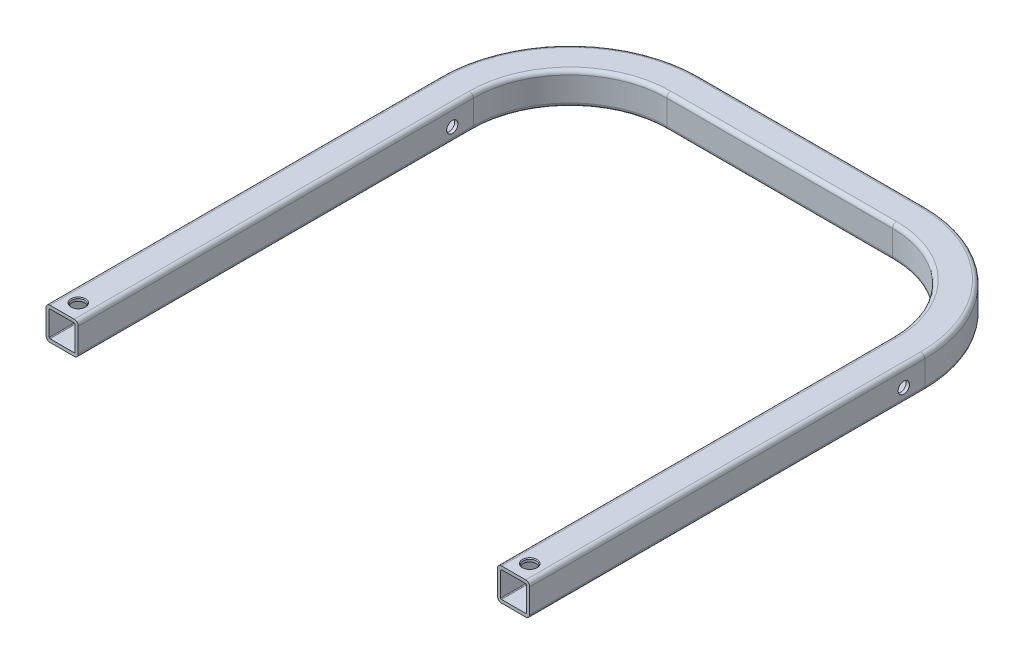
ISO-10303-21;
HEADER;
FILE_DESCRIPTION(('STEP AP214'),'2;1');
FILE_NAME('part.step','',(''),(''),'','','');
FILE_SCHEMA(('AUTOMOTIVE_DESIGN { 1 0 10303 214 1 1 1 1 }'));
ENDSEC;
DATA;
#1=APPLICATION_CONTEXT('core data for automotive mechanical design processes');
#2=APPLICATION_PROTOCOL_DEFINITION('international standard','automotive_design',2000,#1);
#3=PRODUCT_CONTEXT('',#1,'mechanical');
#4=PRODUCT('Part','Part','',(#3));
#5=PRODUCT_RELATED_PRODUCT_CATEGORY('part','',(#4));
#6=PRODUCT_DEFINITION_FORMATION('','',#4);
#7=PRODUCT_DEFINITION_CONTEXT('part definition',#1,'design');
#8=PRODUCT_DEFINITION('design','',#6,#7);
#9=PRODUCT_DEFINITION_SHAPE('','',#8);
#10=(LENGTH_UNIT() NAMED_UNIT(*) SI_UNIT(.MILLI.,.METRE.));
#11=(NAMED_UNIT(*) PLANE_ANGLE_UNIT() SI_UNIT($,.RADIAN.));
#12=(NAMED_UNIT(*) SI_UNIT($,.STERADIAN.) SOLID_ANGLE_UNIT());
#13=UNCERTAINTY_MEASURE_WITH_UNIT(LENGTH_MEASURE(1.E-05),#10,'distance_accuracy_value','');
#14=(GEOMETRIC_REPRESENTATION_CONTEXT(3) GLOBAL_UNCERTAINTY_ASSIGNED_CONTEXT((#13)) GLOBAL_UNIT_ASSIGNED_CONTEXT((#10,
#11,#12)) REPRESENTATION_CONTEXT('',''));
#15=CARTESIAN_POINT('',(0.,0.,0.));
#16=DIRECTION('',(0.,0.,1.));
#17=DIRECTION('',(1.,0.,0.));
#18=AXIS2_PLACEMENT_3D('',#15,#16,#17);
#19=CARTESIAN_POINT('',(150.,-2.5,-245.));
#20=DIRECTION('',(-1.,0.,0.));
#21=DIRECTION('',(0.,0.,1.));
#22=AXIS2_PLACEMENT_3D('',#19,#20,#21);
#23=PLANE('',#22);
#24=CARTESIAN_POINT('',(150.,-11.5,-232.));
#25=DIRECTION('',(-1.,0.,0.));
#26=DIRECTION('',(0.,0.,1.));
#27=AXIS2_PLACEMENT_3D('',#24,#25,#26);
#28=CIRCLE('',#27,3.49999999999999);
#29=CARTESIAN_POINT('',(150.,-11.5,-228.5));
#30=VERTEX_POINT('',#29);
#31=EDGE_CURVE('E852',#30,#30,#28,.T.);
#32=ORIENTED_EDGE('',*,*,#31,.T.);
#33=EDGE_LOOP('',(#32));
#34=FACE_BOUND('',#33,.T.);
#35=DIRECTION('',(0.,-1.,0.));
#36=VECTOR('',#35,1.);
#37=CARTESIAN_POINT('',(150.,-2.5,-245.));
#38=LINE('',#37,#36);
#39=CARTESIAN_POINT('',(150.,-2.5,-245.));
#40=VERTEX_POINT('',#39);
#41=CARTESIAN_POINT('',(150.,-17.5,-245.));
#42=VERTEX_POINT('',#41);
#43=EDGE_CURVE('E673',#40,#42,#38,.T.);
#44=ORIENTED_EDGE('',*,*,#43,.F.);
#45=DIRECTION('',(0.,0.,1.));
#46=VECTOR('',#45,1.);
#47=CARTESIAN_POINT('',(150.,-2.5,-245.));
#48=LINE('',#47,#46);
#49=CARTESIAN_POINT('',(150.,-2.5,0.));
#50=VERTEX_POINT('',#49);
#51=EDGE_CURVE('E801',#40,#50,#48,.T.);
#52=ORIENTED_EDGE('',*,*,#51,.T.);
#53=DIRECTION('',(0.,-1.,0.));
#54=VECTOR('',#53,1.);
#55=CARTESIAN_POINT('',(150.,-2.5,0.));
#56=LINE('',#55,#54);
#57=CARTESIAN_POINT('',(150.,-17.5,0.));
#58=VERTEX_POINT('',#57);
#59=EDGE_CURVE('E48',#50,#58,#56,.T.);
#60=ORIENTED_EDGE('',*,*,#59,.T.);
#61=DIRECTION('',(0.,0.,1.));
#62=VECTOR('',#61,1.);
#63=CARTESIAN_POINT('',(150.,-17.5,-245.));
#64=LINE('',#63,#62);
#65=EDGE_CURVE('E803',#42,#58,#64,.T.);
#66=ORIENTED_EDGE('',*,*,#65,.F.);
#67=EDGE_LOOP('',(#44,#52,#60,#66));
#68=FACE_BOUND('',#67,.T.);
#69=ADVANCED_FACE('F32',(#34,#68),#23,.F.);
#70=CARTESIAN_POINT('',(147.5,-2.5,-245.));
#71=DIRECTION('',(0.,0.,1.));
#72=DIRECTION('',(1.,0.,0.));
#73=AXIS2_PLACEMENT_3D('',#70,#71,#72);
#74=CYLINDRICAL_SURFACE('',#73,2.5);
#75=CARTESIAN_POINT('',(147.5,-2.5,-245.));
#76=DIRECTION('',(0.,0.,-1.));
#77=DIRECTION('',(-1.,0.,0.));
#78=AXIS2_PLACEMENT_3D('',#75,#76,#77);
#79=CIRCLE('',#78,2.5);
#80=CARTESIAN_POINT('',(147.5,0.,-245.));
#81=VERTEX_POINT('',#80);
#82=EDGE_CURVE('E670',#81,#40,#79,.T.);
#83=ORIENTED_EDGE('',*,*,#82,.F.);
#84=DIRECTION('',(0.,0.,1.));
#85=VECTOR('',#84,1.);
#86=CARTESIAN_POINT('',(147.5,0.,-245.));
#87=LINE('',#86,#85);
#88=CARTESIAN_POINT('',(147.5,0.,0.));
#89=VERTEX_POINT('',#88);
#90=EDGE_CURVE('E799',#81,#89,#87,.T.);
#91=ORIENTED_EDGE('',*,*,#90,.T.);
#92=CARTESIAN_POINT('',(147.5,-2.5,0.));
#93=DIRECTION('',(0.,0.,-1.));
#94=DIRECTION('',(-1.,0.,0.));
#95=AXIS2_PLACEMENT_3D('',#92,#93,#94);
#96=CIRCLE('',#95,2.5);
#97=EDGE_CURVE('E56',#89,#50,#96,.T.);
#98=ORIENTED_EDGE('',*,*,#97,.T.);
#99=ORIENTED_EDGE('',*,*,#51,.F.);
#100=EDGE_LOOP('',(#83,#91,#98,#99));
#101=FACE_BOUND('',#100,.T.);
#102=ADVANCED_FACE('F878',(#101),#74,.T.);
#103=CARTESIAN_POINT('',(132.5,-2.5,-245.));
#104=DIRECTION('',(0.,0.,1.));
#105=DIRECTION('',(1.,0.,0.));
#106=AXIS2_PLACEMENT_3D('',#103,#104,#105);
#107=CYLINDRICAL_SURFACE('',#106,2.5);
#108=CARTESIAN_POINT('',(132.5,-2.5,-245.));
#109=DIRECTION('',(0.,0.,-1.));
#110=DIRECTION('',(1.,0.,0.));
#111=AXIS2_PLACEMENT_3D('',#108,#109,#110);
#112=CIRCLE('',#111,2.5);
#113=CARTESIAN_POINT('',(130.,-2.5,-245.));
#114=VERTEX_POINT('',#113);
#115=CARTESIAN_POINT('',(132.5,0.,-245.));
#116=VERTEX_POINT('',#115);
#117=EDGE_CURVE('E667',#114,#116,#112,.T.);
#118=ORIENTED_EDGE('',*,*,#117,.F.);
#119=DIRECTION('',(0.,0.,1.));
#120=VECTOR('',#119,1.);
#121=CARTESIAN_POINT('',(130.,-2.5,-245.));
#122=LINE('',#121,#120);
#123=CARTESIAN_POINT('',(130.,-2.5,0.));
#124=VERTEX_POINT('',#123);
#125=EDGE_CURVE('E793',#114,#124,#122,.T.);
#126=ORIENTED_EDGE('',*,*,#125,.T.);
#127=CARTESIAN_POINT('',(132.5,-2.5,0.));
#128=DIRECTION('',(0.,0.,-1.));
#129=DIRECTION('',(1.,0.,0.));
#130=AXIS2_PLACEMENT_3D('',#127,#128,#129);
#131=CIRCLE('',#130,2.5);
#132=CARTESIAN_POINT('',(132.5,0.,0.));
#133=VERTEX_POINT('',#132);
#134=EDGE_CURVE('E756',#124,#133,#131,.T.);
#135=ORIENTED_EDGE('',*,*,#134,.T.);
#136=DIRECTION('',(0.,0.,1.));
#137=VECTOR('',#136,1.);
#138=CARTESIAN_POINT('',(132.5,0.,-245.));
#139=LINE('',#138,#137);
#140=EDGE_CURVE('E796',#116,#133,#139,.T.);
#141=ORIENTED_EDGE('',*,*,#140,.F.);
#142=EDGE_LOOP('',(#118,#126,#135,#141));
#143=FACE_BOUND('',#142,.T.);
#144=ADVANCED_FACE('F883',(#143),#107,.T.);
#145=CARTESIAN_POINT('',(130.,-2.5,-245.));
#146=DIRECTION('',(1.,0.,0.));
#147=DIRECTION('',(0.,0.,-1.));
#148=AXIS2_PLACEMENT_3D('',#145,#146,#147);
#149=PLANE('',#148);
#150=CARTESIAN_POINT('',(130.,-11.5,-232.));
#151=DIRECTION('',(1.,0.,0.));
#152=DIRECTION('',(0.,0.,-1.));
#153=AXIS2_PLACEMENT_3D('',#150,#151,#152);
#154=CIRCLE('',#153,3.49999999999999);
#155=CARTESIAN_POINT('',(130.,-11.5,-235.5));
#156=VERTEX_POINT('',#155);
#157=EDGE_CURVE('E832',#156,#156,#154,.T.);
#158=ORIENTED_EDGE('',*,*,#157,.T.);
#159=EDGE_LOOP('',(#158));
#160=FACE_BOUND('',#159,.T.);
#161=DIRECTION('',(0.,1.,0.));
#162=VECTOR('',#161,1.);
#163=CARTESIAN_POINT('',(130.,-2.5,-245.));
#164=LINE('',#163,#162);
#165=CARTESIAN_POINT('',(130.,-17.5,-245.));
#166=VERTEX_POINT('',#165);
#167=EDGE_CURVE('E664',#166,#114,#164,.T.);
#168=ORIENTED_EDGE('',*,*,#167,.F.);
#169=DIRECTION('',(0.,0.,1.));
#170=VECTOR('',#169,1.);
#171=CARTESIAN_POINT('',(130.,-17.5,-245.));
#172=LINE('',#171,#170);
#173=CARTESIAN_POINT('',(130.,-17.5,0.));
#174=VERTEX_POINT('',#173);
#175=EDGE_CURVE('E790',#166,#174,#172,.T.);
#176=ORIENTED_EDGE('',*,*,#175,.T.);
#177=DIRECTION('',(0.,1.,0.));
#178=VECTOR('',#177,1.);
#179=CARTESIAN_POINT('',(130.,-2.5,0.));
#180=LINE('',#179,#178);
#181=EDGE_CURVE('E754',#174,#124,#180,.T.);
#182=ORIENTED_EDGE('',*,*,#181,.T.);
#183=ORIENTED_EDGE('',*,*,#125,.F.);
#184=EDGE_LOOP('',(#168,#176,#182,#183));
#185=FACE_BOUND('',#184,.T.);
#186=ADVANCED_FACE('F888',(#160,#185),#149,.F.);
#187=CARTESIAN_POINT('',(132.5,-17.5,-245.));
#188=DIRECTION('',(0.,0.,1.));
#189=DIRECTION('',(1.,0.,0.));
#190=AXIS2_PLACEMENT_3D('',#187,#188,#189);
#191=CYLINDRICAL_SURFACE('',#190,2.5);
#192=CARTESIAN_POINT('',(132.5,-17.5,-245.));
#193=DIRECTION('',(0.,0.,-1.));
#194=DIRECTION('',(-1.,0.,0.));
#195=AXIS2_PLACEMENT_3D('',#192,#193,#194);
#196=CIRCLE('',#195,2.5);
#197=CARTESIAN_POINT('',(132.5,-20.,-245.));
#198=VERTEX_POINT('',#197);
#199=EDGE_CURVE('E660',#198,#166,#196,.T.);
#200=ORIENTED_EDGE('',*,*,#199,.F.);
#201=DIRECTION('',(0.,0.,1.));
#202=VECTOR('',#201,1.);
#203=CARTESIAN_POINT('',(132.5,-20.,-245.));
#204=LINE('',#203,#202);
#205=CARTESIAN_POINT('',(132.5,-20.,0.));
#206=VERTEX_POINT('',#205);
#207=EDGE_CURVE('E787',#198,#206,#204,.T.);
#208=ORIENTED_EDGE('',*,*,#207,.T.);
#209=CARTESIAN_POINT('',(132.5,-17.5,0.));
#210=DIRECTION('',(0.,0.,-1.));
#211=DIRECTION('',(-1.,0.,0.));
#212=AXIS2_PLACEMENT_3D('',#209,#210,#211);
#213=CIRCLE('',#212,2.5);
#214=EDGE_CURVE('E752',#206,#174,#213,.T.);
#215=ORIENTED_EDGE('',*,*,#214,.T.);
#216=ORIENTED_EDGE('',*,*,#175,.F.);
#217=EDGE_LOOP('',(#200,#208,#215,#216));
#218=FACE_BOUND('',#217,.T.);
#219=ADVANCED_FACE('F892',(#218),#191,.T.);
#220=CARTESIAN_POINT('',(147.5,-17.5,-245.));
#221=DIRECTION('',(0.,0.,1.));
#222=DIRECTION('',(1.,0.,0.));
#223=AXIS2_PLACEMENT_3D('',#220,#221,#222);
#224=CYLINDRICAL_SURFACE('',#223,2.5);
#225=CARTESIAN_POINT('',(147.5,-17.5,-245.));
#226=DIRECTION('',(0.,0.,-1.));
#227=DIRECTION('',(-1.,0.,0.));
#228=AXIS2_PLACEMENT_3D('',#225,#226,#227);
#229=CIRCLE('',#228,2.5);
#230=CARTESIAN_POINT('',(147.5,-20.,-245.));
#231=VERTEX_POINT('',#230);
#232=EDGE_CURVE('E657',#42,#231,#229,.T.);
#233=ORIENTED_EDGE('',*,*,#232,.F.);
#234=ORIENTED_EDGE('',*,*,#65,.T.);
#235=CARTESIAN_POINT('',(147.5,-17.5,0.));
#236=DIRECTION('',(0.,0.,-1.));
#237=DIRECTION('',(-1.,0.,0.));
#238=AXIS2_PLACEMENT_3D('',#235,#236,#237);
#239=CIRCLE('',#238,2.5);
#240=CARTESIAN_POINT('',(147.5,-20.,0.));
#241=VERTEX_POINT('',#240);
#242=EDGE_CURVE('E747',#58,#241,#239,.T.);
#243=ORIENTED_EDGE('',*,*,#242,.T.);
#244=DIRECTION('',(0.,0.,1.));
#245=VECTOR('',#244,1.);
#246=CARTESIAN_POINT('',(147.5,-20.,-245.));
#247=LINE('',#246,#245);
#248=EDGE_CURVE('E762',#231,#241,#247,.T.);
#249=ORIENTED_EDGE('',*,*,#248,.F.);
#250=EDGE_LOOP('',(#233,#234,#243,#249));
#251=FACE_BOUND('',#250,.T.);
#252=ADVANCED_FACE('F896',(#251),#224,.T.);
#253=CARTESIAN_POINT('',(148.,-2.5,-245.));
#254=DIRECTION('',(-1.,0.,0.));
#255=DIRECTION('',(0.,0.,1.));
#256=AXIS2_PLACEMENT_3D('',#253,#254,#255);
#257=PLANE('',#256);
#258=CARTESIAN_POINT('',(148.,-11.5,-232.));
#259=DIRECTION('',(-1.,0.,0.));
#260=DIRECTION('',(0.,0.,1.));
#261=AXIS2_PLACEMENT_3D('',#258,#259,#260);
#262=CIRCLE('',#261,3.49999999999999);
#263=CARTESIAN_POINT('',(148.,-11.5,-228.5));
#264=VERTEX_POINT('',#263);
#265=EDGE_CURVE('E835',#264,#264,#262,.T.);
#266=ORIENTED_EDGE('',*,*,#265,.F.);
#267=EDGE_LOOP('',(#266));
#268=FACE_BOUND('',#267,.T.);
#269=DIRECTION('',(0.,-1.,0.));
#270=VECTOR('',#269,1.);
#271=CARTESIAN_POINT('',(148.,-2.5,-245.));
#272=LINE('',#271,#270);
#273=CARTESIAN_POINT('',(148.,-2.5,-245.));
#274=VERTEX_POINT('',#273);
#275=CARTESIAN_POINT('',(148.,-17.5,-245.));
#276=VERTEX_POINT('',#275);
#277=EDGE_CURVE('E653',#274,#276,#272,.T.);
#278=ORIENTED_EDGE('',*,*,#277,.T.);
#279=DIRECTION('',(0.,0.,1.));
#280=VECTOR('',#279,1.);
#281=CARTESIAN_POINT('',(148.,-17.5,-245.));
#282=LINE('',#281,#280);
#283=CARTESIAN_POINT('',(148.,-17.5,0.));
#284=VERTEX_POINT('',#283);
#285=EDGE_CURVE('E780',#276,#284,#282,.T.);
#286=ORIENTED_EDGE('',*,*,#285,.T.);
#287=DIRECTION('',(0.,-1.,0.));
#288=VECTOR('',#287,1.);
#289=CARTESIAN_POINT('',(148.,-2.5,0.));
#290=LINE('',#289,#288);
#291=CARTESIAN_POINT('',(148.,-2.5,0.));
#292=VERTEX_POINT('',#291);
#293=EDGE_CURVE('E743',#292,#284,#290,.T.);
#294=ORIENTED_EDGE('',*,*,#293,.F.);
#295=DIRECTION('',(0.,0.,1.));
#296=VECTOR('',#295,1.);
#297=CARTESIAN_POINT('',(148.,-2.5,-245.));
#298=LINE('',#297,#296);
#299=EDGE_CURVE('E750',#274,#292,#298,.T.);
#300=ORIENTED_EDGE('',*,*,#299,.F.);
#301=EDGE_LOOP('',(#278,#286,#294,#300));
#302=FACE_BOUND('',#301,.T.);
#303=ADVANCED_FACE('F900',(#268,#302),#257,.T.);
#304=CARTESIAN_POINT('',(147.5,-17.5,-245.));
#305=DIRECTION('',(0.,0.,1.));
#306=DIRECTION('',(1.,0.,0.));
#307=AXIS2_PLACEMENT_3D('',#304,#305,#306);
#308=CYLINDRICAL_SURFACE('',#307,0.5);
#309=CARTESIAN_POINT('',(147.5,-17.5,-245.));
#310=DIRECTION('',(0.,0.,-1.));
#311=DIRECTION('',(-1.,0.,0.));
#312=AXIS2_PLACEMENT_3D('',#309,#310,#311);
#313=CIRCLE('',#312,0.5);
#314=CARTESIAN_POINT('',(147.5,-18.,-245.));
#315=VERTEX_POINT('',#314);
#316=EDGE_CURVE('E650',#276,#315,#313,.T.);
#317=ORIENTED_EDGE('',*,*,#316,.T.);
#318=DIRECTION('',(0.,0.,1.));
#319=VECTOR('',#318,1.);
#320=CARTESIAN_POINT('',(147.5,-18.,-245.));
#321=LINE('',#320,#319);
#322=CARTESIAN_POINT('',(147.5,-18.,0.));
#323=VERTEX_POINT('',#322);
#324=EDGE_CURVE('E777',#315,#323,#321,.T.);
#325=ORIENTED_EDGE('',*,*,#324,.T.);
#326=CARTESIAN_POINT('',(147.5,-17.5,0.));
#327=DIRECTION('',(0.,0.,-1.));
#328=DIRECTION('',(-1.,0.,0.));
#329=AXIS2_PLACEMENT_3D('',#326,#327,#328);
#330=CIRCLE('',#329,0.5);
#331=EDGE_CURVE('E740',#284,#323,#330,.T.);
#332=ORIENTED_EDGE('',*,*,#331,.F.);
#333=ORIENTED_EDGE('',*,*,#285,.F.);
#334=EDGE_LOOP('',(#317,#325,#332,#333));
#335=FACE_BOUND('',#334,.T.);
#336=ADVANCED_FACE('F904',(#335),#308,.F.);
#337=CARTESIAN_POINT('',(132.5,-17.5,-245.));
#338=DIRECTION('',(0.,0.,1.));
#339=DIRECTION('',(1.,0.,0.));
#340=AXIS2_PLACEMENT_3D('',#337,#338,#339);
#341=CYLINDRICAL_SURFACE('',#340,0.500000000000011);
#342=CARTESIAN_POINT('',(132.5,-17.5,-245.));
#343=DIRECTION('',(0.,0.,-1.));
#344=DIRECTION('',(-1.,0.,0.));
#345=AXIS2_PLACEMENT_3D('',#342,#343,#344);
#346=CIRCLE('',#345,0.500000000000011);
#347=CARTESIAN_POINT('',(132.5,-18.,-245.));
#348=VERTEX_POINT('',#347);
#349=CARTESIAN_POINT('',(132.,-17.5,-245.));
#350=VERTEX_POINT('',#349);
#351=EDGE_CURVE('E647',#348,#350,#346,.T.);
#352=ORIENTED_EDGE('',*,*,#351,.T.);
#353=DIRECTION('',(0.,0.,1.));
#354=VECTOR('',#353,1.);
#355=CARTESIAN_POINT('',(132.,-17.5,-245.));
#356=LINE('',#355,#354);
#357=CARTESIAN_POINT('',(132.,-17.5,0.));
#358=VERTEX_POINT('',#357);
#359=EDGE_CURVE('E771',#350,#358,#356,.T.);
#360=ORIENTED_EDGE('',*,*,#359,.T.);
#361=CARTESIAN_POINT('',(132.5,-17.5,0.));
#362=DIRECTION('',(0.,0.,-1.));
#363=DIRECTION('',(-1.,0.,0.));
#364=AXIS2_PLACEMENT_3D('',#361,#362,#363);
#365=CIRCLE('',#364,0.500000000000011);
#366=CARTESIAN_POINT('',(132.5,-18.,0.));
#367=VERTEX_POINT('',#366);
#368=EDGE_CURVE('E734',#367,#358,#365,.T.);
#369=ORIENTED_EDGE('',*,*,#368,.F.);
#370=DIRECTION('',(0.,0.,1.));
#371=VECTOR('',#370,1.);
#372=CARTESIAN_POINT('',(132.5,-18.,-245.));
#373=LINE('',#372,#371);
#374=EDGE_CURVE('E774',#348,#367,#373,.T.);
#375=ORIENTED_EDGE('',*,*,#374,.F.);
#376=EDGE_LOOP('',(#352,#360,#369,#375));
#377=FACE_BOUND('',#376,.T.);
#378=ADVANCED_FACE('F908',(#377),#341,.F.);
#379=CARTESIAN_POINT('',(132.,-2.5,-245.));
#380=DIRECTION('',(1.,0.,0.));
#381=DIRECTION('',(0.,1.,0.));
#382=AXIS2_PLACEMENT_3D('',#379,#380,#381);
#383=PLANE('',#382);
#384=CARTESIAN_POINT('',(132.,-11.5,-232.));
#385=DIRECTION('',(1.,0.,0.));
#386=DIRECTION('',(0.,1.,0.));
#387=AXIS2_PLACEMENT_3D('',#384,#385,#386);
#388=CIRCLE('',#387,3.49999999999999);
#389=CARTESIAN_POINT('',(132.,-8.00000000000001,-232.));
#390=VERTEX_POINT('',#389);
#391=EDGE_CURVE('E840',#390,#390,#388,.T.);
#392=ORIENTED_EDGE('',*,*,#391,.F.);
#393=EDGE_LOOP('',(#392));
#394=FACE_BOUND('',#393,.T.);
#395=DIRECTION('',(0.,1.,0.));
#396=VECTOR('',#395,1.);
#397=CARTESIAN_POINT('',(132.,-2.5,-245.));
#398=LINE('',#397,#396);
#399=CARTESIAN_POINT('',(132.,-2.5,-245.));
#400=VERTEX_POINT('',#399);
#401=EDGE_CURVE('E644',#350,#400,#398,.T.);
#402=ORIENTED_EDGE('',*,*,#401,.T.);
#403=DIRECTION('',(0.,0.,1.));
#404=VECTOR('',#403,1.);
#405=CARTESIAN_POINT('',(132.,-2.5,-245.));
#406=LINE('',#405,#404);
#407=CARTESIAN_POINT('',(132.,-2.5,0.));
#408=VERTEX_POINT('',#407);
#409=EDGE_CURVE('E768',#400,#408,#406,.T.);
#410=ORIENTED_EDGE('',*,*,#409,.T.);
#411=DIRECTION('',(0.,1.,0.));
#412=VECTOR('',#411,1.);
#413=CARTESIAN_POINT('',(132.,-2.5,0.));
#414=LINE('',#413,#412);
#415=EDGE_CURVE('E731',#358,#408,#414,.T.);
#416=ORIENTED_EDGE('',*,*,#415,.F.);
#417=ORIENTED_EDGE('',*,*,#359,.F.);
#418=EDGE_LOOP('',(#402,#410,#416,#417));
#419=FACE_BOUND('',#418,.T.);
#420=ADVANCED_FACE('F912',(#394,#419),#383,.T.);
#421=CARTESIAN_POINT('',(132.5,-2.5,-245.));
#422=DIRECTION('',(0.,0.,1.));
#423=DIRECTION('',(1.,0.,0.));
#424=AXIS2_PLACEMENT_3D('',#421,#422,#423);
#425=CYLINDRICAL_SURFACE('',#424,0.5);
#426=CARTESIAN_POINT('',(132.5,-2.5,-245.));
#427=DIRECTION('',(0.,0.,-1.));
#428=DIRECTION('',(1.,0.,0.));
#429=AXIS2_PLACEMENT_3D('',#426,#427,#428);
#430=CIRCLE('',#429,0.5);
#431=CARTESIAN_POINT('',(132.5,-2.,-245.));
#432=VERTEX_POINT('',#431);
#433=EDGE_CURVE('E641',#400,#432,#430,.T.);
#434=ORIENTED_EDGE('',*,*,#433,.T.);
#435=DIRECTION('',(0.,0.,1.));
#436=VECTOR('',#435,1.);
#437=CARTESIAN_POINT('',(132.5,-2.,-245.));
#438=LINE('',#437,#436);
#439=CARTESIAN_POINT('',(132.5,-2.,0.));
#440=VERTEX_POINT('',#439);
#441=EDGE_CURVE('E765',#432,#440,#438,.T.);
#442=ORIENTED_EDGE('',*,*,#441,.T.);
#443=CARTESIAN_POINT('',(132.5,-2.5,0.));
#444=DIRECTION('',(0.,0.,-1.));
#445=DIRECTION('',(1.,0.,0.));
#446=AXIS2_PLACEMENT_3D('',#443,#444,#445);
#447=CIRCLE('',#446,0.5);
#448=EDGE_CURVE('E728',#408,#440,#447,.T.);
#449=ORIENTED_EDGE('',*,*,#448,.F.);
#450=ORIENTED_EDGE('',*,*,#409,.F.);
#451=EDGE_LOOP('',(#434,#442,#449,#450));
#452=FACE_BOUND('',#451,.T.);
#453=ADVANCED_FACE('F916',(#452),#425,.F.);
#454=CARTESIAN_POINT('',(147.5,-2.5,-245.));
#455=DIRECTION('',(0.,0.,1.));
#456=DIRECTION('',(1.,0.,0.));
#457=AXIS2_PLACEMENT_3D('',#454,#455,#456);
#458=CYLINDRICAL_SURFACE('',#457,0.5);
#459=CARTESIAN_POINT('',(147.5,-2.5,-245.));
#460=DIRECTION('',(0.,0.,-1.));
#461=DIRECTION('',(-1.,0.,0.));
#462=AXIS2_PLACEMENT_3D('',#459,#460,#461);
#463=CIRCLE('',#462,0.5);
#464=CARTESIAN_POINT('',(147.5,-2.,-245.));
#465=VERTEX_POINT('',#464);
#466=EDGE_CURVE('E638',#465,#274,#463,.T.);
#467=ORIENTED_EDGE('',*,*,#466,.T.);
#468=ORIENTED_EDGE('',*,*,#299,.T.);
#469=CARTESIAN_POINT('',(147.5,-2.5,0.));
#470=DIRECTION('',(0.,0.,-1.));
#471=DIRECTION('',(-1.,0.,0.));
#472=AXIS2_PLACEMENT_3D('',#469,#470,#471);
#473=CIRCLE('',#472,0.5);
#474=CARTESIAN_POINT('',(147.5,-2.,0.));
#475=VERTEX_POINT('',#474);
#476=EDGE_CURVE('E722',#475,#292,#473,.T.);
#477=ORIENTED_EDGE('',*,*,#476,.F.);
#478=DIRECTION('',(0.,0.,1.));
#479=VECTOR('',#478,1.);
#480=CARTESIAN_POINT('',(147.5,-2.,-245.));
#481=LINE('',#480,#479);
#482=EDGE_CURVE('E746',#465,#475,#481,.T.);
#483=ORIENTED_EDGE('',*,*,#482,.F.);
#484=EDGE_LOOP('',(#467,#468,#477,#483));
#485=FACE_BOUND('',#484,.T.);
#486=ADVANCED_FACE('F920',(#485),#458,.F.);
#487=CARTESIAN_POINT('',(70.,0.,-245.));
#488=DIRECTION('',(0.,-1.,0.));
#489=DIRECTION('',(0.,0.,-1.));
#490=AXIS2_PLACEMENT_3D('',#487,#488,#489);
#491=CYLINDRICAL_SURFACE('',#490,80.0000000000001);
#492=DIRECTION('',(0.,-1.,0.));
#493=VECTOR('',#492,1.);
#494=CARTESIAN_POINT('',(70.,-2.5,-325.));
#495=LINE('',#494,#493);
#496=CARTESIAN_POINT('',(70.,-2.5,-325.));
#497=VERTEX_POINT('',#496);
#498=CARTESIAN_POINT('',(70.,-17.5,-325.));
#499=VERTEX_POINT('',#498);
#500=EDGE_CURVE('E590',#497,#499,#495,.T.);
#501=ORIENTED_EDGE('',*,*,#500,.F.);
#502=CARTESIAN_POINT('',(70.,-2.5,-245.));
#503=DIRECTION('',(0.,-1.,0.));
#504=DIRECTION('',(0.,0.,-1.));
#505=AXIS2_PLACEMENT_3D('',#502,#503,#504);
#506=CIRCLE('',#505,80.0000000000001);
#507=EDGE_CURVE('E716',#497,#40,#506,.T.);
#508=ORIENTED_EDGE('',*,*,#507,.T.);
#509=ORIENTED_EDGE('',*,*,#43,.T.);
#510=CARTESIAN_POINT('',(70.,-17.5,-245.));
#511=DIRECTION('',(0.,-1.,0.));
#512=DIRECTION('',(0.,0.,-1.));
#513=AXIS2_PLACEMENT_3D('',#510,#511,#512);
#514=CIRCLE('',#513,80.0000000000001);
#515=EDGE_CURVE('E719',#499,#42,#514,.T.);
#516=ORIENTED_EDGE('',*,*,#515,.F.);
#517=EDGE_LOOP('',(#501,#508,#509,#516));
#518=FACE_BOUND('',#517,.T.);
#519=ADVANCED_FACE('F924',(#518),#491,.T.);
#520=CARTESIAN_POINT('',(70.,-2.5,-245.));
#521=DIRECTION('',(0.,-1.,0.));
#522=DIRECTION('',(0.,0.,-1.));
#523=AXIS2_PLACEMENT_3D('',#520,#521,#522);
#524=TOROIDAL_SURFACE('',#523,77.5,2.5);
#525=CARTESIAN_POINT('',(70.,-2.5,-322.5));
#526=DIRECTION('',(-1.,0.,0.));
#527=DIRECTION('',(0.,0.,1.));
#528=AXIS2_PLACEMENT_3D('',#525,#526,#527);
#529=CIRCLE('',#528,2.5);
#530=CARTESIAN_POINT('',(70.,0.,-322.5));
#531=VERTEX_POINT('',#530);
#532=EDGE_CURVE('E587',#531,#497,#529,.T.);
#533=ORIENTED_EDGE('',*,*,#532,.F.);
#534=CARTESIAN_POINT('',(70.,0.,-245.));
#535=DIRECTION('',(0.,-1.,0.));
#536=DIRECTION('',(0.,0.,-1.));
#537=AXIS2_PLACEMENT_3D('',#534,#535,#536);
#538=CIRCLE('',#537,77.5);
#539=EDGE_CURVE('E713',#531,#81,#538,.T.);
#540=ORIENTED_EDGE('',*,*,#539,.T.);
#541=ORIENTED_EDGE('',*,*,#82,.T.);
#542=ORIENTED_EDGE('',*,*,#507,.F.);
#543=EDGE_LOOP('',(#533,#540,#541,#542));
#544=FACE_BOUND('',#543,.T.);
#545=ADVANCED_FACE('F928',(#544),#524,.T.);
#546=CARTESIAN_POINT('',(70.,-2.5,-245.));
#547=DIRECTION('',(0.,-1.,0.));
#548=DIRECTION('',(0.,0.,-1.));
#549=AXIS2_PLACEMENT_3D('',#546,#547,#548);
#550=TOROIDAL_SURFACE('',#549,62.5000000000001,2.5);
#551=CARTESIAN_POINT('',(70.,-2.5,-307.5));
#552=DIRECTION('',(-1.,0.,0.));
#553=DIRECTION('',(0.,0.,-1.));
#554=AXIS2_PLACEMENT_3D('',#551,#552,#553);
#555=CIRCLE('',#554,2.5);
#556=CARTESIAN_POINT('',(70.,-2.5,-305.));
#557=VERTEX_POINT('',#556);
#558=CARTESIAN_POINT('',(70.,0.,-307.5));
#559=VERTEX_POINT('',#558);
#560=EDGE_CURVE('E584',#557,#559,#555,.T.);
#561=ORIENTED_EDGE('',*,*,#560,.F.);
#562=CARTESIAN_POINT('',(70.,-2.5,-245.));
#563=DIRECTION('',(0.,-1.,0.));
#564=DIRECTION('',(0.,0.,-1.));
#565=AXIS2_PLACEMENT_3D('',#562,#563,#564);
#566=CIRCLE('',#565,60.0000000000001);
#567=EDGE_CURVE('E707',#557,#114,#566,.T.);
#568=ORIENTED_EDGE('',*,*,#567,.T.);
#569=ORIENTED_EDGE('',*,*,#117,.T.);
#570=CARTESIAN_POINT('',(70.,0.,-245.));
#571=DIRECTION('',(0.,-1.,0.));
#572=DIRECTION('',(0.,0.,-1.));
#573=AXIS2_PLACEMENT_3D('',#570,#571,#572);
#574=CIRCLE('',#573,62.5000000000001);
#575=EDGE_CURVE('E710',#559,#116,#574,.T.);
#576=ORIENTED_EDGE('',*,*,#575,.F.);
#577=EDGE_LOOP('',(#561,#568,#569,#576));
#578=FACE_BOUND('',#577,.T.);
#579=ADVANCED_FACE('F932',(#578),#550,.T.);
#580=CARTESIAN_POINT('',(70.,0.,-245.));
#581=DIRECTION('',(0.,-1.,0.));
#582=DIRECTION('',(0.,0.,-1.));
#583=AXIS2_PLACEMENT_3D('',#580,#581,#582);
#584=CYLINDRICAL_SURFACE('',#583,60.0000000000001);
#585=DIRECTION('',(0.,1.,0.));
#586=VECTOR('',#585,1.);
#587=CARTESIAN_POINT('',(70.,-2.5,-305.));
#588=LINE('',#587,#586);
#589=CARTESIAN_POINT('',(70.,-17.5,-305.));
#590=VERTEX_POINT('',#589);
#591=EDGE_CURVE('E581',#590,#557,#588,.T.);
#592=ORIENTED_EDGE('',*,*,#591,.F.);
#593=CARTESIAN_POINT('',(70.,-17.5,-245.));
#594=DIRECTION('',(0.,-1.,0.));
#595=DIRECTION('',(0.,0.,-1.));
#596=AXIS2_PLACEMENT_3D('',#593,#594,#595);
#597=CIRCLE('',#596,60.0000000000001);
#598=EDGE_CURVE('E704',#590,#166,#597,.T.);
#599=ORIENTED_EDGE('',*,*,#598,.T.);
#600=ORIENTED_EDGE('',*,*,#167,.T.);
#601=ORIENTED_EDGE('',*,*,#567,.F.);
#602=EDGE_LOOP('',(#592,#599,#600,#601));
#603=FACE_BOUND('',#602,.T.);
#604=ADVANCED_FACE('F936',(#603),#584,.F.);
#605=CARTESIAN_POINT('',(70.,-17.5,-245.));
#606=DIRECTION('',(0.,-1.,0.));
#607=DIRECTION('',(0.,0.,-1.));
#608=AXIS2_PLACEMENT_3D('',#605,#606,#607);
#609=TOROIDAL_SURFACE('',#608,62.5000000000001,2.5);
#610=CARTESIAN_POINT('',(70.,-17.5,-307.5));
#611=DIRECTION('',(-1.,0.,0.));
#612=DIRECTION('',(0.,0.,1.));
#613=AXIS2_PLACEMENT_3D('',#610,#611,#612);
#614=CIRCLE('',#613,2.5);
#615=CARTESIAN_POINT('',(70.,-20.,-307.5));
#616=VERTEX_POINT('',#615);
#617=EDGE_CURVE('E577',#616,#590,#614,.T.);
#618=ORIENTED_EDGE('',*,*,#617,.F.);
#619=CARTESIAN_POINT('',(70.,-20.,-245.));
#620=DIRECTION('',(0.,-1.,0.));
#621=DIRECTION('',(0.,0.,-1.));
#622=AXIS2_PLACEMENT_3D('',#619,#620,#621);
#623=CIRCLE('',#622,62.5000000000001);
#624=EDGE_CURVE('E701',#616,#198,#623,.T.);
#625=ORIENTED_EDGE('',*,*,#624,.T.);
#626=ORIENTED_EDGE('',*,*,#199,.T.);
#627=ORIENTED_EDGE('',*,*,#598,.F.);
#628=EDGE_LOOP('',(#618,#625,#626,#627));
#629=FACE_BOUND('',#628,.T.);
#630=ADVANCED_FACE('F940',(#629),#609,.T.);
#631=CARTESIAN_POINT('',(70.,-17.5,-245.));
#632=DIRECTION('',(0.,-1.,0.));
#633=DIRECTION('',(0.,0.,-1.));
#634=AXIS2_PLACEMENT_3D('',#631,#632,#633);
#635=TOROIDAL_SURFACE('',#634,77.5,2.5);
#636=CARTESIAN_POINT('',(70.,-17.5,-322.5));
#637=DIRECTION('',(-1.,0.,0.));
#638=DIRECTION('',(0.,0.,1.));
#639=AXIS2_PLACEMENT_3D('',#636,#637,#638);
#640=CIRCLE('',#639,2.5);
#641=CARTESIAN_POINT('',(70.,-20.,-322.5));
#642=VERTEX_POINT('',#641);
#643=EDGE_CURVE('E574',#499,#642,#640,.T.);
#644=ORIENTED_EDGE('',*,*,#643,.F.);
#645=ORIENTED_EDGE('',*,*,#515,.T.);
#646=ORIENTED_EDGE('',*,*,#232,.T.);
#647=CARTESIAN_POINT('',(70.,-20.,-245.));
#648=DIRECTION('',(0.,-1.,0.));
#649=DIRECTION('',(0.,0.,-1.));
#650=AXIS2_PLACEMENT_3D('',#647,#648,#649);
#651=CIRCLE('',#650,77.5);
#652=EDGE_CURVE('E676',#642,#231,#651,.T.);
#653=ORIENTED_EDGE('',*,*,#652,.F.);
#654=EDGE_LOOP('',(#644,#645,#646,#653));
#655=FACE_BOUND('',#654,.T.);
#656=ADVANCED_FACE('F944',(#655),#635,.T.);
#657=CARTESIAN_POINT('',(70.,0.,-245.));
#658=DIRECTION('',(0.,-1.,0.));
#659=DIRECTION('',(0.,0.,-1.));
#660=AXIS2_PLACEMENT_3D('',#657,#658,#659);
#661=CYLINDRICAL_SURFACE('',#660,78.0000000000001);
#662=DIRECTION('',(0.,-1.,0.));
#663=VECTOR('',#662,1.);
#664=CARTESIAN_POINT('',(70.,-2.5,-323.));
#665=LINE('',#664,#663);
#666=CARTESIAN_POINT('',(70.,-2.5,-323.));
#667=VERTEX_POINT('',#666);
#668=CARTESIAN_POINT('',(70.,-17.5,-323.));
#669=VERTEX_POINT('',#668);
#670=EDGE_CURVE('E570',#667,#669,#665,.T.);
#671=ORIENTED_EDGE('',*,*,#670,.T.);
#672=CARTESIAN_POINT('',(70.,-17.5,-245.));
#673=DIRECTION('',(0.,-1.,0.));
#674=DIRECTION('',(0.,0.,-1.));
#675=AXIS2_PLACEMENT_3D('',#672,#673,#674);
#676=CIRCLE('',#675,78.0000000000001);
#677=EDGE_CURVE('E694',#669,#276,#676,.T.);
#678=ORIENTED_EDGE('',*,*,#677,.T.);
#679=ORIENTED_EDGE('',*,*,#277,.F.);
#680=CARTESIAN_POINT('',(70.,-2.5,-245.));
#681=DIRECTION('',(0.,-1.,0.));
#682=DIRECTION('',(0.,0.,-1.));
#683=AXIS2_PLACEMENT_3D('',#680,#681,#682);
#684=CIRCLE('',#683,78.0000000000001);
#685=EDGE_CURVE('E661',#667,#274,#684,.T.);
#686=ORIENTED_EDGE('',*,*,#685,.F.);
#687=EDGE_LOOP('',(#671,#678,#679,#686));
#688=FACE_BOUND('',#687,.T.);
#689=ADVANCED_FACE('F948',(#688),#661,.F.);
#690=CARTESIAN_POINT('',(70.,-17.5,-245.));
#691=DIRECTION('',(0.,-1.,0.));
#692=DIRECTION('',(0.,0.,-1.));
#693=AXIS2_PLACEMENT_3D('',#690,#691,#692);
#694=TOROIDAL_SURFACE('',#693,77.5,0.5);
#695=CARTESIAN_POINT('',(70.,-17.5,-322.5));
#696=DIRECTION('',(-1.,0.,0.));
#697=DIRECTION('',(0.,0.,1.));
#698=AXIS2_PLACEMENT_3D('',#695,#696,#697);
#699=CIRCLE('',#698,0.5);
#700=CARTESIAN_POINT('',(70.,-18.,-322.5));
#701=VERTEX_POINT('',#700);
#702=EDGE_CURVE('E567',#669,#701,#699,.T.);
#703=ORIENTED_EDGE('',*,*,#702,.T.);
#704=CARTESIAN_POINT('',(70.,-18.,-245.));
#705=DIRECTION('',(0.,-1.,0.));
#706=DIRECTION('',(0.,0.,-1.));
#707=AXIS2_PLACEMENT_3D('',#704,#705,#706);
#708=CIRCLE('',#707,77.5);
#709=EDGE_CURVE('E691',#701,#315,#708,.T.);
#710=ORIENTED_EDGE('',*,*,#709,.T.);
#711=ORIENTED_EDGE('',*,*,#316,.F.);
#712=ORIENTED_EDGE('',*,*,#677,.F.);
#713=EDGE_LOOP('',(#703,#710,#711,#712));
#714=FACE_BOUND('',#713,.T.);
#715=ADVANCED_FACE('F952',(#714),#694,.F.);
#716=CARTESIAN_POINT('',(70.,-17.5,-245.));
#717=DIRECTION('',(0.,-1.,0.));
#718=DIRECTION('',(0.,0.,-1.));
#719=AXIS2_PLACEMENT_3D('',#716,#717,#718);
#720=TOROIDAL_SURFACE('',#719,62.5000000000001,0.500000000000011);
#721=CARTESIAN_POINT('',(70.,-17.5,-307.5));
#722=DIRECTION('',(-1.,0.,0.));
#723=DIRECTION('',(0.,0.,1.));
#724=AXIS2_PLACEMENT_3D('',#721,#722,#723);
#725=CIRCLE('',#724,0.500000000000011);
#726=CARTESIAN_POINT('',(70.,-18.,-307.5));
#727=VERTEX_POINT('',#726);
#728=CARTESIAN_POINT('',(70.,-17.5,-307.));
#729=VERTEX_POINT('',#728);
#730=EDGE_CURVE('E564',#727,#729,#725,.T.);
#731=ORIENTED_EDGE('',*,*,#730,.T.);
#732=CARTESIAN_POINT('',(70.,-17.5,-245.));
#733=DIRECTION('',(0.,-1.,0.));
#734=DIRECTION('',(0.,0.,-1.));
#735=AXIS2_PLACEMENT_3D('',#732,#733,#734);
#736=CIRCLE('',#735,62.0000000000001);
#737=EDGE_CURVE('E685',#729,#350,#736,.T.);
#738=ORIENTED_EDGE('',*,*,#737,.T.);
#739=ORIENTED_EDGE('',*,*,#351,.F.);
#740=CARTESIAN_POINT('',(70.,-18.,-245.));
#741=DIRECTION('',(0.,-1.,0.));
#742=DIRECTION('',(0.,0.,-1.));
#743=AXIS2_PLACEMENT_3D('',#740,#741,#742);
#744=CIRCLE('',#743,62.5000000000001);
#745=EDGE_CURVE('E688',#727,#348,#744,.T.);
#746=ORIENTED_EDGE('',*,*,#745,.F.);
#747=EDGE_LOOP('',(#731,#738,#739,#746));
#748=FACE_BOUND('',#747,.T.);
#749=ADVANCED_FACE('F956',(#748),#720,.F.);
#750=CARTESIAN_POINT('',(70.,0.,-245.));
#751=DIRECTION('',(0.,-1.,0.));
#752=DIRECTION('',(0.,0.,-1.));
#753=AXIS2_PLACEMENT_3D('',#750,#751,#752);
#754=CYLINDRICAL_SURFACE('',#753,62.0000000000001);
#755=DIRECTION('',(0.,1.,0.));
#756=VECTOR('',#755,1.);
#757=CARTESIAN_POINT('',(70.,-2.5,-307.));
#758=LINE('',#757,#756);
#759=CARTESIAN_POINT('',(70.,-2.5,-307.));
#760=VERTEX_POINT('',#759);
#761=EDGE_CURVE('E561',#729,#760,#758,.T.);
#762=ORIENTED_EDGE('',*,*,#761,.T.);
#763=CARTESIAN_POINT('',(70.,-2.5,-245.));
#764=DIRECTION('',(0.,-1.,0.));
#765=DIRECTION('',(0.,0.,-1.));
#766=AXIS2_PLACEMENT_3D('',#763,#764,#765);
#767=CIRCLE('',#766,62.0000000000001);
#768=EDGE_CURVE('E682',#760,#400,#767,.T.);
#769=ORIENTED_EDGE('',*,*,#768,.T.);
#770=ORIENTED_EDGE('',*,*,#401,.F.);
#771=ORIENTED_EDGE('',*,*,#737,.F.);
#772=EDGE_LOOP('',(#762,#769,#770,#771));
#773=FACE_BOUND('',#772,.T.);
#774=ADVANCED_FACE('F960',(#773),#754,.T.);
#775=CARTESIAN_POINT('',(70.,-2.5,-245.));
#776=DIRECTION('',(0.,-1.,0.));
#777=DIRECTION('',(0.,0.,-1.));
#778=AXIS2_PLACEMENT_3D('',#775,#776,#777);
#779=TOROIDAL_SURFACE('',#778,62.5000000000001,0.5);
#780=CARTESIAN_POINT('',(70.,-2.5,-307.5));
#781=DIRECTION('',(-1.,0.,0.));
#782=DIRECTION('',(0.,0.,-1.));
#783=AXIS2_PLACEMENT_3D('',#780,#781,#782);
#784=CIRCLE('',#783,0.5);
#785=CARTESIAN_POINT('',(70.,-2.,-307.5));
#786=VERTEX_POINT('',#785);
#787=EDGE_CURVE('E558',#760,#786,#784,.T.);
#788=ORIENTED_EDGE('',*,*,#787,.T.);
#789=CARTESIAN_POINT('',(70.,-2.,-245.));
#790=DIRECTION('',(0.,-1.,0.));
#791=DIRECTION('',(0.,0.,-1.));
#792=AXIS2_PLACEMENT_3D('',#789,#790,#791);
#793=CIRCLE('',#792,62.5000000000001);
#794=EDGE_CURVE('E679',#786,#432,#793,.T.);
#795=ORIENTED_EDGE('',*,*,#794,.T.);
#796=ORIENTED_EDGE('',*,*,#433,.F.);
#797=ORIENTED_EDGE('',*,*,#768,.F.);
#798=EDGE_LOOP('',(#788,#795,#796,#797));
#799=FACE_BOUND('',#798,.T.);
#800=ADVANCED_FACE('F964',(#799),#779,.F.);
#801=CARTESIAN_POINT('',(70.,-2.5,-245.));
#802=DIRECTION('',(0.,-1.,0.));
#803=DIRECTION('',(0.,0.,-1.));
#804=AXIS2_PLACEMENT_3D('',#801,#802,#803);
#805=TOROIDAL_SURFACE('',#804,77.5,0.5);
#806=CARTESIAN_POINT('',(70.,-2.5,-322.5));
#807=DIRECTION('',(-1.,0.,0.));
#808=DIRECTION('',(0.,0.,1.));
#809=AXIS2_PLACEMENT_3D('',#806,#807,#808);
#810=CIRCLE('',#809,0.5);
#811=CARTESIAN_POINT('',(70.,-2.,-322.5));
#812=VERTEX_POINT('',#811);
#813=EDGE_CURVE('E555',#812,#667,#810,.T.);
#814=ORIENTED_EDGE('',*,*,#813,.T.);
#815=ORIENTED_EDGE('',*,*,#685,.T.);
#816=ORIENTED_EDGE('',*,*,#466,.F.);
#817=CARTESIAN_POINT('',(70.,-2.,-245.));
#818=DIRECTION('',(0.,-1.,0.));
#819=DIRECTION('',(0.,0.,-1.));
#820=AXIS2_PLACEMENT_3D('',#817,#818,#819);
#821=CIRCLE('',#820,77.5);
#822=EDGE_CURVE('E656',#812,#465,#821,.T.);
#823=ORIENTED_EDGE('',*,*,#822,.F.);
#824=EDGE_LOOP('',(#814,#815,#816,#823));
#825=FACE_BOUND('',#824,.T.);
#826=ADVANCED_FACE('F968',(#825),#805,.F.);
#827=CARTESIAN_POINT('',(-70.,-2.5,-325.));
#828=DIRECTION('',(0.,0.,1.));
#829=DIRECTION('',(1.,0.,0.));
#830=AXIS2_PLACEMENT_3D('',#827,#828,#829);
#831=PLANE('',#830);
#832=DIRECTION('',(0.,-1.,0.));
#833=VECTOR('',#832,1.);
#834=CARTESIAN_POINT('',(-70.,-2.5,-325.));
#835=LINE('',#834,#833);
#836=CARTESIAN_POINT('',(-70.,-2.5,-325.));
#837=VERTEX_POINT('',#836);
#838=CARTESIAN_POINT('',(-70.,-17.5,-325.));
#839=VERTEX_POINT('',#838);
#840=EDGE_CURVE('E510',#837,#839,#835,.T.);
#841=ORIENTED_EDGE('',*,*,#840,.F.);
#842=DIRECTION('',(1.,0.,0.));
#843=VECTOR('',#842,1.);
#844=CARTESIAN_POINT('',(-70.,-2.5,-325.));
#845=LINE('',#844,#843);
#846=EDGE_CURVE('E632',#837,#497,#845,.T.);
#847=ORIENTED_EDGE('',*,*,#846,.T.);
#848=ORIENTED_EDGE('',*,*,#500,.T.);
#849=DIRECTION('',(1.,0.,0.));
#850=VECTOR('',#849,1.);
#851=CARTESIAN_POINT('',(-70.,-17.5,-325.));
#852=LINE('',#851,#850);
#853=EDGE_CURVE('E635',#839,#499,#852,.T.);
#854=ORIENTED_EDGE('',*,*,#853,.F.);
#855=EDGE_LOOP('',(#841,#847,#848,#854));
#856=FACE_BOUND('',#855,.T.);
#857=ADVANCED_FACE('F972',(#856),#831,.F.);
#858=CARTESIAN_POINT('',(-70.,-2.5,-322.5));
#859=DIRECTION('',(1.,0.,0.));
#860=DIRECTION('',(0.,0.,-1.));
#861=AXIS2_PLACEMENT_3D('',#858,#859,#860);
#862=CYLINDRICAL_SURFACE('',#861,2.5);
#863=CARTESIAN_POINT('',(-70.,-2.5,-322.5));
#864=DIRECTION('',(-1.,0.,0.));
#865=DIRECTION('',(0.,0.,1.));
#866=AXIS2_PLACEMENT_3D('',#863,#864,#865);
#867=CIRCLE('',#866,2.5);
#868=CARTESIAN_POINT('',(-70.,0.,-322.5));
#869=VERTEX_POINT('',#868);
#870=EDGE_CURVE('E507',#869,#837,#867,.T.);
#871=ORIENTED_EDGE('',*,*,#870,.F.);
#872=DIRECTION('',(1.,0.,0.));
#873=VECTOR('',#872,1.);
#874=CARTESIAN_POINT('',(-70.,0.,-322.5));
#875=LINE('',#874,#873);
#876=EDGE_CURVE('E629',#869,#531,#875,.T.);
#877=ORIENTED_EDGE('',*,*,#876,.T.);
#878=ORIENTED_EDGE('',*,*,#532,.T.);
#879=ORIENTED_EDGE('',*,*,#846,.F.);
#880=EDGE_LOOP('',(#871,#877,#878,#879));
#881=FACE_BOUND('',#880,.T.);
#882=ADVANCED_FACE('F976',(#881),#862,.T.);
#883=CARTESIAN_POINT('',(-70.,-2.5,-307.5));
#884=DIRECTION('',(1.,0.,0.));
#885=DIRECTION('',(0.,0.,-1.));
#886=AXIS2_PLACEMENT_3D('',#883,#884,#885);
#887=CYLINDRICAL_SURFACE('',#886,2.5);
#888=CARTESIAN_POINT('',(-70.,-2.5,-307.5));
#889=DIRECTION('',(-1.,0.,0.));
#890=DIRECTION('',(0.,0.,-1.));
#891=AXIS2_PLACEMENT_3D('',#888,#889,#890);
#892=CIRCLE('',#891,2.5);
#893=CARTESIAN_POINT('',(-70.,-2.5,-305.));
#894=VERTEX_POINT('',#893);
#895=CARTESIAN_POINT('',(-70.,0.,-307.5));
#896=VERTEX_POINT('',#895);
#897=EDGE_CURVE('E504',#894,#896,#892,.T.);
#898=ORIENTED_EDGE('',*,*,#897,.F.);
#899=DIRECTION('',(1.,0.,0.));
#900=VECTOR('',#899,1.);
#901=CARTESIAN_POINT('',(-70.,-2.5,-305.));
#902=LINE('',#901,#900);
#903=EDGE_CURVE('E623',#894,#557,#902,.T.);
#904=ORIENTED_EDGE('',*,*,#903,.T.);
#905=ORIENTED_EDGE('',*,*,#560,.T.);
#906=DIRECTION('',(1.,0.,0.));
#907=VECTOR('',#906,1.);
#908=CARTESIAN_POINT('',(-70.,0.,-307.5));
#909=LINE('',#908,#907);
#910=EDGE_CURVE('E626',#896,#559,#909,.T.);
#911=ORIENTED_EDGE('',*,*,#910,.F.);
#912=EDGE_LOOP('',(#898,#904,#905,#911));
#913=FACE_BOUND('',#912,.T.);
#914=ADVANCED_FACE('F980',(#913),#887,.T.);
#915=CARTESIAN_POINT('',(-70.,-2.5,-305.));
#916=DIRECTION('',(0.,0.,-1.));
#917=DIRECTION('',(-1.,0.,0.));
#918=AXIS2_PLACEMENT_3D('',#915,#916,#917);
#919=PLANE('',#918);
#920=DIRECTION('',(0.,1.,0.));
#921=VECTOR('',#920,1.);
#922=CARTESIAN_POINT('',(-70.,-2.5,-305.));
#923=LINE('',#922,#921);
#924=CARTESIAN_POINT('',(-70.,-17.5,-305.));
#925=VERTEX_POINT('',#924);
#926=EDGE_CURVE('E501',#925,#894,#923,.T.);
#927=ORIENTED_EDGE('',*,*,#926,.F.);
#928=DIRECTION('',(1.,0.,0.));
#929=VECTOR('',#928,1.);
#930=CARTESIAN_POINT('',(-70.,-17.5,-305.));
#931=LINE('',#930,#929);
#932=EDGE_CURVE('E620',#925,#590,#931,.T.);
#933=ORIENTED_EDGE('',*,*,#932,.T.);
#934=ORIENTED_EDGE('',*,*,#591,.T.);
#935=ORIENTED_EDGE('',*,*,#903,.F.);
#936=EDGE_LOOP('',(#927,#933,#934,#935));
#937=FACE_BOUND('',#936,.T.);
#938=ADVANCED_FACE('F984',(#937),#919,.F.);
#939=CARTESIAN_POINT('',(-70.,-17.5,-307.5));
#940=DIRECTION('',(1.,0.,0.));
#941=DIRECTION('',(0.,0.,-1.));
#942=AXIS2_PLACEMENT_3D('',#939,#940,#941);
#943=CYLINDRICAL_SURFACE('',#942,2.5);
#944=CARTESIAN_POINT('',(-70.,-17.5,-307.5));
#945=DIRECTION('',(-1.,0.,0.));
#946=DIRECTION('',(0.,0.,1.));
#947=AXIS2_PLACEMENT_3D('',#944,#945,#946);
#948=CIRCLE('',#947,2.5);
#949=CARTESIAN_POINT('',(-70.,-20.,-307.5));
#950=VERTEX_POINT('',#949);
#951=EDGE_CURVE('E497',#950,#925,#948,.T.);
#952=ORIENTED_EDGE('',*,*,#951,.F.);
#953=DIRECTION('',(1.,0.,0.));
#954=VECTOR('',#953,1.);
#955=CARTESIAN_POINT('',(-70.,-20.,-307.5));
#956=LINE('',#955,#954);
#957=EDGE_CURVE('E617',#950,#616,#956,.T.);
#958=ORIENTED_EDGE('',*,*,#957,.T.);
#959=ORIENTED_EDGE('',*,*,#617,.T.);
#960=ORIENTED_EDGE('',*,*,#932,.F.);
#961=EDGE_LOOP('',(#952,#958,#959,#960));
#962=FACE_BOUND('',#961,.T.);
#963=ADVANCED_FACE('F988',(#962),#943,.T.);
#964=CARTESIAN_POINT('',(-70.,-17.5,-322.5));
#965=DIRECTION('',(1.,0.,0.));
#966=DIRECTION('',(0.,0.,-1.));
#967=AXIS2_PLACEMENT_3D('',#964,#965,#966);
#968=CYLINDRICAL_SURFACE('',#967,2.5);
#969=CARTESIAN_POINT('',(-70.,-17.5,-322.5));
#970=DIRECTION('',(-1.,0.,0.));
#971=DIRECTION('',(0.,0.,1.));
#972=AXIS2_PLACEMENT_3D('',#969,#970,#971);
#973=CIRCLE('',#972,2.5);
#974=CARTESIAN_POINT('',(-70.,-20.,-322.5));
#975=VERTEX_POINT('',#974);
#976=EDGE_CURVE('E494',#839,#975,#973,.T.);
#977=ORIENTED_EDGE('',*,*,#976,.F.);
#978=ORIENTED_EDGE('',*,*,#853,.T.);
#979=ORIENTED_EDGE('',*,*,#643,.T.);
#980=DIRECTION('',(1.,0.,0.));
#981=VECTOR('',#980,1.);
#982=CARTESIAN_POINT('',(-70.,-20.,-322.5));
#983=LINE('',#982,#981);
#984=EDGE_CURVE('E593',#975,#642,#983,.T.);
#985=ORIENTED_EDGE('',*,*,#984,.F.);
#986=EDGE_LOOP('',(#977,#978,#979,#985));
#987=FACE_BOUND('',#986,.T.);
#988=ADVANCED_FACE('F992',(#987),#968,.T.);
#989=CARTESIAN_POINT('',(-70.,-2.5,-323.));
#990=DIRECTION('',(0.,0.,1.));
#991=DIRECTION('',(1.,0.,0.));
#992=AXIS2_PLACEMENT_3D('',#989,#990,#991);
#993=PLANE('',#992);
#994=DIRECTION('',(0.,-1.,0.));
#995=VECTOR('',#994,1.);
#996=CARTESIAN_POINT('',(-70.,-2.5,-323.));
#997=LINE('',#996,#995);
#998=CARTESIAN_POINT('',(-70.,-2.5,-323.));
#999=VERTEX_POINT('',#998);
#1000=CARTESIAN_POINT('',(-70.,-17.5,-323.));
#1001=VERTEX_POINT('',#1000);
#1002=EDGE_CURVE('E352',#999,#1001,#997,.T.);
#1003=ORIENTED_EDGE('',*,*,#1002,.T.);
#1004=DIRECTION('',(1.,0.,0.));
#1005=VECTOR('',#1004,1.);
#1006=CARTESIAN_POINT('',(-70.,-17.5,-323.));
#1007=LINE('',#1006,#1005);
#1008=EDGE_CURVE('E610',#1001,#669,#1007,.T.);
#1009=ORIENTED_EDGE('',*,*,#1008,.T.);
#1010=ORIENTED_EDGE('',*,*,#670,.F.);
#1011=DIRECTION('',(1.,0.,0.));
#1012=VECTOR('',#1011,1.);
#1013=CARTESIAN_POINT('',(-70.,-2.5,-323.));
#1014=LINE('',#1013,#1012);
#1015=EDGE_CURVE('E578',#999,#667,#1014,.T.);
#1016=ORIENTED_EDGE('',*,*,#1015,.F.);
#1017=EDGE_LOOP('',(#1003,#1009,#1010,#1016));
#1018=FACE_BOUND('',#1017,.T.);
#1019=ADVANCED_FACE('F996',(#1018),#993,.T.);
#1020=CARTESIAN_POINT('',(-70.,-17.5,-322.5));
#1021=DIRECTION('',(1.,0.,0.));
#1022=DIRECTION('',(0.,0.,-1.));
#1023=AXIS2_PLACEMENT_3D('',#1020,#1021,#1022);
#1024=CYLINDRICAL_SURFACE('',#1023,0.5);
#1025=CARTESIAN_POINT('',(-70.,-17.5,-322.5));
#1026=DIRECTION('',(-1.,0.,0.));
#1027=DIRECTION('',(0.,0.,1.));
#1028=AXIS2_PLACEMENT_3D('',#1025,#1026,#1027);
#1029=CIRCLE('',#1028,0.5);
#1030=CARTESIAN_POINT('',(-70.,-18.,-322.5));
#1031=VERTEX_POINT('',#1030);
#1032=EDGE_CURVE('E489',#1001,#1031,#1029,.T.);
#1033=ORIENTED_EDGE('',*,*,#1032,.T.);
#1034=DIRECTION('',(1.,0.,0.));
#1035=VECTOR('',#1034,1.);
#1036=CARTESIAN_POINT('',(-70.,-18.,-322.5));
#1037=LINE('',#1036,#1035);
#1038=EDGE_CURVE('E607',#1031,#701,#1037,.T.);
#1039=ORIENTED_EDGE('',*,*,#1038,.T.);
#1040=ORIENTED_EDGE('',*,*,#702,.F.);
#1041=ORIENTED_EDGE('',*,*,#1008,.F.);
#1042=EDGE_LOOP('',(#1033,#1039,#1040,#1041));
#1043=FACE_BOUND('',#1042,.T.);
#1044=ADVANCED_FACE('F1000',(#1043),#1024,.F.);
#1045=CARTESIAN_POINT('',(-70.,-17.5,-307.5));
#1046=DIRECTION('',(1.,0.,0.));
#1047=DIRECTION('',(0.,0.,-1.));
#1048=AXIS2_PLACEMENT_3D('',#1045,#1046,#1047);
#1049=CYLINDRICAL_SURFACE('',#1048,0.500000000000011);
#1050=CARTESIAN_POINT('',(-70.,-17.5,-307.5));
#1051=DIRECTION('',(-1.,0.,0.));
#1052=DIRECTION('',(0.,0.,1.));
#1053=AXIS2_PLACEMENT_3D('',#1050,#1051,#1052);
#1054=CIRCLE('',#1053,0.500000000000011);
#1055=CARTESIAN_POINT('',(-70.,-18.,-307.5));
#1056=VERTEX_POINT('',#1055);
#1057=CARTESIAN_POINT('',(-70.,-17.5,-307.));
#1058=VERTEX_POINT('',#1057);
#1059=EDGE_CURVE('E486',#1056,#1058,#1054,.T.);
#1060=ORIENTED_EDGE('',*,*,#1059,.T.);
#1061=DIRECTION('',(1.,0.,0.));
#1062=VECTOR('',#1061,1.);
#1063=CARTESIAN_POINT('',(-70.,-17.5,-307.));
#1064=LINE('',#1063,#1062);
#1065=EDGE_CURVE('E601',#1058,#729,#1064,.T.);
#1066=ORIENTED_EDGE('',*,*,#1065,.T.);
#1067=ORIENTED_EDGE('',*,*,#730,.F.);
#1068=DIRECTION('',(1.,0.,0.));
#1069=VECTOR('',#1068,1.);
#1070=CARTESIAN_POINT('',(-70.,-18.,-307.5));
#1071=LINE('',#1070,#1069);
#1072=EDGE_CURVE('E604',#1056,#727,#1071,.T.);
#1073=ORIENTED_EDGE('',*,*,#1072,.F.);
#1074=EDGE_LOOP('',(#1060,#1066,#1067,#1073));
#1075=FACE_BOUND('',#1074,.T.);
#1076=ADVANCED_FACE('F1004',(#1075),#1049,.F.);
#1077=CARTESIAN_POINT('',(-70.,-2.5,-307.));
#1078=DIRECTION('',(0.,0.,-1.));
#1079=DIRECTION('',(0.,1.,0.));
#1080=AXIS2_PLACEMENT_3D('',#1077,#1078,#1079);
#1081=PLANE('',#1080);
#1082=DIRECTION('',(0.,1.,0.));
#1083=VECTOR('',#1082,1.);
#1084=CARTESIAN_POINT('',(-70.,-2.5,-307.));
#1085=LINE('',#1084,#1083);
#1086=CARTESIAN_POINT('',(-70.,-2.5,-307.));
#1087=VERTEX_POINT('',#1086);
#1088=EDGE_CURVE('E483',#1058,#1087,#1085,.T.);
#1089=ORIENTED_EDGE('',*,*,#1088,.T.);
#1090=DIRECTION('',(1.,0.,0.));
#1091=VECTOR('',#1090,1.);
#1092=CARTESIAN_POINT('',(-70.,-2.5,-307.));
#1093=LINE('',#1092,#1091);
#1094=EDGE_CURVE('E598',#1087,#760,#1093,.T.);
#1095=ORIENTED_EDGE('',*,*,#1094,.T.);
#1096=ORIENTED_EDGE('',*,*,#761,.F.);
#1097=ORIENTED_EDGE('',*,*,#1065,.F.);
#1098=EDGE_LOOP('',(#1089,#1095,#1096,#1097));
#1099=FACE_BOUND('',#1098,.T.);
#1100=ADVANCED_FACE('F1008',(#1099),#1081,.T.);
#1101=CARTESIAN_POINT('',(-70.,-2.5,-307.5));
#1102=DIRECTION('',(1.,0.,0.));
#1103=DIRECTION('',(0.,0.,-1.));
#1104=AXIS2_PLACEMENT_3D('',#1101,#1102,#1103);
#1105=CYLINDRICAL_SURFACE('',#1104,0.5);
#1106=CARTESIAN_POINT('',(-70.,-2.5,-307.5));
#1107=DIRECTION('',(-1.,0.,0.));
#1108=DIRECTION('',(0.,0.,-1.));
#1109=AXIS2_PLACEMENT_3D('',#1106,#1107,#1108);
#1110=CIRCLE('',#1109,0.5);
#1111=CARTESIAN_POINT('',(-70.,-2.,-307.5));
#1112=VERTEX_POINT('',#1111);
#1113=EDGE_CURVE('E480',#1087,#1112,#1110,.T.);
#1114=ORIENTED_EDGE('',*,*,#1113,.T.);
#1115=DIRECTION('',(1.,0.,0.));
#1116=VECTOR('',#1115,1.);
#1117=CARTESIAN_POINT('',(-70.,-2.,-307.5));
#1118=LINE('',#1117,#1116);
#1119=EDGE_CURVE('E595',#1112,#786,#1118,.T.);
#1120=ORIENTED_EDGE('',*,*,#1119,.T.);
#1121=ORIENTED_EDGE('',*,*,#787,.F.);
#1122=ORIENTED_EDGE('',*,*,#1094,.F.);
#1123=EDGE_LOOP('',(#1114,#1120,#1121,#1122));
#1124=FACE_BOUND('',#1123,.T.);
#1125=ADVANCED_FACE('F1012',(#1124),#1105,.F.);
#1126=CARTESIAN_POINT('',(-70.,-2.5,-322.5));
#1127=DIRECTION('',(1.,0.,0.));
#1128=DIRECTION('',(0.,0.,-1.));
#1129=AXIS2_PLACEMENT_3D('',#1126,#1127,#1128);
#1130=CYLINDRICAL_SURFACE('',#1129,0.5);
#1131=CARTESIAN_POINT('',(-70.,-2.5,-322.5));
#1132=DIRECTION('',(-1.,0.,0.));
#1133=DIRECTION('',(0.,0.,1.));
#1134=AXIS2_PLACEMENT_3D('',#1131,#1132,#1133);
#1135=CIRCLE('',#1134,0.5);
#1136=CARTESIAN_POINT('',(-70.,-2.,-322.5));
#1137=VERTEX_POINT('',#1136);
#1138=EDGE_CURVE('E348',#1137,#999,#1135,.T.);
#1139=ORIENTED_EDGE('',*,*,#1138,.T.);
#1140=ORIENTED_EDGE('',*,*,#1015,.T.);
#1141=ORIENTED_EDGE('',*,*,#813,.F.);
#1142=DIRECTION('',(1.,0.,0.));
#1143=VECTOR('',#1142,1.);
#1144=CARTESIAN_POINT('',(-70.,-2.,-322.5));
#1145=LINE('',#1144,#1143);
#1146=EDGE_CURVE('E573',#1137,#812,#1145,.T.);
#1147=ORIENTED_EDGE('',*,*,#1146,.F.);
#1148=EDGE_LOOP('',(#1139,#1140,#1141,#1147));
#1149=FACE_BOUND('',#1148,.T.);
#1150=ADVANCED_FACE('F1016',(#1149),#1130,.F.);
#1151=CARTESIAN_POINT('',(-70.,0.,-245.));
#1152=DIRECTION('',(0.,-1.,0.));
#1153=DIRECTION('',(0.,0.,-1.));
#1154=AXIS2_PLACEMENT_3D('',#1151,#1152,#1153);
#1155=CYLINDRICAL_SURFACE('',#1154,80.);
#1156=DIRECTION('',(0.,-1.,0.));
#1157=VECTOR('',#1156,1.);
#1158=CARTESIAN_POINT('',(-150.,-2.5,-245.));
#1159=LINE('',#1158,#1157);
#1160=CARTESIAN_POINT('',(-150.,-2.5,-245.));
#1161=VERTEX_POINT('',#1160);
#1162=CARTESIAN_POINT('',(-150.,-17.5,-245.));
#1163=VERTEX_POINT('',#1162);
#1164=EDGE_CURVE('E364',#1161,#1163,#1159,.T.);
#1165=ORIENTED_EDGE('',*,*,#1164,.F.);
#1166=CARTESIAN_POINT('',(-70.,-2.5,-245.));
#1167=DIRECTION('',(0.,-1.,0.));
#1168=DIRECTION('',(0.,0.,-1.));
#1169=AXIS2_PLACEMENT_3D('',#1166,#1167,#1168);
#1170=CIRCLE('',#1169,80.);
#1171=EDGE_CURVE('E549',#1161,#837,#1170,.T.);
#1172=ORIENTED_EDGE('',*,*,#1171,.T.);
#1173=ORIENTED_EDGE('',*,*,#840,.T.);
#1174=CARTESIAN_POINT('',(-70.,-17.5,-245.));
#1175=DIRECTION('',(0.,-1.,0.));
#1176=DIRECTION('',(0.,0.,-1.));
#1177=AXIS2_PLACEMENT_3D('',#1174,#1175,#1176);
#1178=CIRCLE('',#1177,80.);
#1179=EDGE_CURVE('E552',#1163,#839,#1178,.T.);
#1180=ORIENTED_EDGE('',*,*,#1179,.F.);
#1181=EDGE_LOOP('',(#1165,#1172,#1173,#1180));
#1182=FACE_BOUND('',#1181,.T.);
#1183=ADVANCED_FACE('F1020',(#1182),#1155,.T.);
#1184=CARTESIAN_POINT('',(-70.,-2.5,-245.));
#1185=DIRECTION('',(0.,-1.,0.));
#1186=DIRECTION('',(0.,0.,-1.));
#1187=AXIS2_PLACEMENT_3D('',#1184,#1185,#1186);
#1188=TOROIDAL_SURFACE('',#1187,77.5,2.5);
#1189=CARTESIAN_POINT('',(-147.5,-2.5,-245.));
#1190=DIRECTION('',(0.,0.,1.));
#1191=DIRECTION('',(1.,0.,0.));
#1192=AXIS2_PLACEMENT_3D('',#1189,#1190,#1191);
#1193=CIRCLE('',#1192,2.5);
#1194=CARTESIAN_POINT('',(-147.5,0.,-245.));
#1195=VERTEX_POINT('',#1194);
#1196=EDGE_CURVE('E406',#1195,#1161,#1193,.T.);
#1197=ORIENTED_EDGE('',*,*,#1196,.F.);
#1198=CARTESIAN_POINT('',(-70.,0.,-245.));
#1199=DIRECTION('',(0.,-1.,0.));
#1200=DIRECTION('',(0.,0.,-1.));
#1201=AXIS2_PLACEMENT_3D('',#1198,#1199,#1200);
#1202=CIRCLE('',#1201,77.5);
#1203=EDGE_CURVE('E546',#1195,#869,#1202,.T.);
#1204=ORIENTED_EDGE('',*,*,#1203,.T.);
#1205=ORIENTED_EDGE('',*,*,#870,.T.);
#1206=ORIENTED_EDGE('',*,*,#1171,.F.);
#1207=EDGE_LOOP('',(#1197,#1204,#1205,#1206));
#1208=FACE_BOUND('',#1207,.T.);
#1209=ADVANCED_FACE('F1024',(#1208),#1188,.T.);
#1210=CARTESIAN_POINT('',(-70.,-2.5,-245.));
#1211=DIRECTION('',(0.,-1.,0.));
#1212=DIRECTION('',(0.,0.,-1.));
#1213=AXIS2_PLACEMENT_3D('',#1210,#1211,#1212);
#1214=TOROIDAL_SURFACE('',#1213,62.5000000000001,2.5);
#1215=CARTESIAN_POINT('',(-132.5,-2.5,-245.));
#1216=DIRECTION('',(0.,0.,1.));
#1217=DIRECTION('',(-1.,0.,0.));
#1218=AXIS2_PLACEMENT_3D('',#1215,#1216,#1217);
#1219=CIRCLE('',#1218,2.5);
#1220=CARTESIAN_POINT('',(-130.,-2.5,-245.));
#1221=VERTEX_POINT('',#1220);
#1222=CARTESIAN_POINT('',(-132.5,0.,-245.));
#1223=VERTEX_POINT('',#1222);
#1224=EDGE_CURVE('E403',#1221,#1223,#1219,.T.);
#1225=ORIENTED_EDGE('',*,*,#1224,.F.);
#1226=CARTESIAN_POINT('',(-70.,-2.5,-245.));
#1227=DIRECTION('',(0.,-1.,0.));
#1228=DIRECTION('',(0.,0.,-1.));
#1229=AXIS2_PLACEMENT_3D('',#1226,#1227,#1228);
#1230=CIRCLE('',#1229,60.0000000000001);
#1231=EDGE_CURVE('E540',#1221,#894,#1230,.T.);
#1232=ORIENTED_EDGE('',*,*,#1231,.T.);
#1233=ORIENTED_EDGE('',*,*,#897,.T.);
#1234=CARTESIAN_POINT('',(-70.,0.,-245.));
#1235=DIRECTION('',(0.,-1.,0.));
#1236=DIRECTION('',(0.,0.,-1.));
#1237=AXIS2_PLACEMENT_3D('',#1234,#1235,#1236);
#1238=CIRCLE('',#1237,62.5000000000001);
#1239=EDGE_CURVE('E543',#1223,#896,#1238,.T.);
#1240=ORIENTED_EDGE('',*,*,#1239,.F.);
#1241=EDGE_LOOP('',(#1225,#1232,#1233,#1240));
#1242=FACE_BOUND('',#1241,.T.);
#1243=ADVANCED_FACE('F1028',(#1242),#1214,.T.);
#1244=CARTESIAN_POINT('',(-70.,0.,-245.));
#1245=DIRECTION('',(0.,-1.,0.));
#1246=DIRECTION('',(0.,0.,-1.));
#1247=AXIS2_PLACEMENT_3D('',#1244,#1245,#1246);
#1248=CYLINDRICAL_SURFACE('',#1247,60.0000000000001);
#1249=DIRECTION('',(0.,1.,0.));
#1250=VECTOR('',#1249,1.);
#1251=CARTESIAN_POINT('',(-130.,-2.5,-245.));
#1252=LINE('',#1251,#1250);
#1253=CARTESIAN_POINT('',(-130.,-17.5,-245.));
#1254=VERTEX_POINT('',#1253);
#1255=EDGE_CURVE('E400',#1254,#1221,#1252,.T.);
#1256=ORIENTED_EDGE('',*,*,#1255,.F.);
#1257=CARTESIAN_POINT('',(-70.,-17.5,-245.));
#1258=DIRECTION('',(0.,-1.,0.));
#1259=DIRECTION('',(0.,0.,-1.));
#1260=AXIS2_PLACEMENT_3D('',#1257,#1258,#1259);
#1261=CIRCLE('',#1260,60.0000000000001);
#1262=EDGE_CURVE('E537',#1254,#925,#1261,.T.);
#1263=ORIENTED_EDGE('',*,*,#1262,.T.);
#1264=ORIENTED_EDGE('',*,*,#926,.T.);
#1265=ORIENTED_EDGE('',*,*,#1231,.F.);
#1266=EDGE_LOOP('',(#1256,#1263,#1264,#1265));
#1267=FACE_BOUND('',#1266,.T.);
#1268=ADVANCED_FACE('F1032',(#1267),#1248,.F.);
#1269=CARTESIAN_POINT('',(-70.,-17.5,-245.));
#1270=DIRECTION('',(0.,-1.,0.));
#1271=DIRECTION('',(0.,0.,-1.));
#1272=AXIS2_PLACEMENT_3D('',#1269,#1270,#1271);
#1273=TOROIDAL_SURFACE('',#1272,62.5000000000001,2.5);
#1274=CARTESIAN_POINT('',(-132.5,-17.5,-245.));
#1275=DIRECTION('',(0.,0.,1.));
#1276=DIRECTION('',(1.,0.,0.));
#1277=AXIS2_PLACEMENT_3D('',#1274,#1275,#1276);
#1278=CIRCLE('',#1277,2.5);
#1279=CARTESIAN_POINT('',(-132.5,-20.,-245.));
#1280=VERTEX_POINT('',#1279);
#1281=EDGE_CURVE('E397',#1280,#1254,#1278,.T.);
#1282=ORIENTED_EDGE('',*,*,#1281,.F.);
#1283=CARTESIAN_POINT('',(-70.,-20.,-245.));
#1284=DIRECTION('',(0.,-1.,0.));
#1285=DIRECTION('',(0.,0.,-1.));
#1286=AXIS2_PLACEMENT_3D('',#1283,#1284,#1285);
#1287=CIRCLE('',#1286,62.5000000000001);
#1288=EDGE_CURVE('E534',#1280,#950,#1287,.T.);
#1289=ORIENTED_EDGE('',*,*,#1288,.T.);
#1290=ORIENTED_EDGE('',*,*,#951,.T.);
#1291=ORIENTED_EDGE('',*,*,#1262,.F.);
#1292=EDGE_LOOP('',(#1282,#1289,#1290,#1291));
#1293=FACE_BOUND('',#1292,.T.);
#1294=ADVANCED_FACE('F1036',(#1293),#1273,.T.);
#1295=CARTESIAN_POINT('',(-70.,-17.5,-245.));
#1296=DIRECTION('',(0.,-1.,0.));
#1297=DIRECTION('',(0.,0.,-1.));
#1298=AXIS2_PLACEMENT_3D('',#1295,#1296,#1297);
#1299=TOROIDAL_SURFACE('',#1298,77.5,2.5);
#1300=CARTESIAN_POINT('',(-147.5,-17.5,-245.));
#1301=DIRECTION('',(0.,0.,1.));
#1302=DIRECTION('',(1.,0.,0.));
#1303=AXIS2_PLACEMENT_3D('',#1300,#1301,#1302);
#1304=CIRCLE('',#1303,2.5);
#1305=CARTESIAN_POINT('',(-147.5,-20.,-245.));
#1306=VERTEX_POINT('',#1305);
#1307=EDGE_CURVE('E394',#1163,#1306,#1304,.T.);
#1308=ORIENTED_EDGE('',*,*,#1307,.F.);
#1309=ORIENTED_EDGE('',*,*,#1179,.T.);
#1310=ORIENTED_EDGE('',*,*,#976,.T.);
#1311=CARTESIAN_POINT('',(-70.,-20.,-245.));
#1312=DIRECTION('',(0.,-1.,0.));
#1313=DIRECTION('',(0.,0.,-1.));
#1314=AXIS2_PLACEMENT_3D('',#1311,#1312,#1313);
#1315=CIRCLE('',#1314,77.5);
#1316=EDGE_CURVE('E512',#1306,#975,#1315,.T.);
#1317=ORIENTED_EDGE('',*,*,#1316,.F.);
#1318=EDGE_LOOP('',(#1308,#1309,#1310,#1317));
#1319=FACE_BOUND('',#1318,.T.);
#1320=ADVANCED_FACE('F1040',(#1319),#1299,.T.);
#1321=CARTESIAN_POINT('',(-70.,0.,-245.));
#1322=DIRECTION('',(0.,-1.,0.));
#1323=DIRECTION('',(0.,0.,-1.));
#1324=AXIS2_PLACEMENT_3D('',#1321,#1322,#1323);
#1325=CYLINDRICAL_SURFACE('',#1324,78.);
#1326=DIRECTION('',(0.,-1.,0.));
#1327=VECTOR('',#1326,1.);
#1328=CARTESIAN_POINT('',(-148.,-2.5,-245.));
#1329=LINE('',#1328,#1327);
#1330=CARTESIAN_POINT('',(-148.,-2.5,-245.));
#1331=VERTEX_POINT('',#1330);
#1332=CARTESIAN_POINT('',(-148.,-17.5,-245.));
#1333=VERTEX_POINT('',#1332);
#1334=EDGE_CURVE('E391',#1331,#1333,#1329,.T.);
#1335=ORIENTED_EDGE('',*,*,#1334,.T.);
#1336=CARTESIAN_POINT('',(-70.,-17.5,-245.));
#1337=DIRECTION('',(0.,-1.,0.));
#1338=DIRECTION('',(0.,0.,-1.));
#1339=AXIS2_PLACEMENT_3D('',#1336,#1337,#1338);
#1340=CIRCLE('',#1339,78.);
#1341=EDGE_CURVE('E528',#1333,#1001,#1340,.T.);
#1342=ORIENTED_EDGE('',*,*,#1341,.T.);
#1343=ORIENTED_EDGE('',*,*,#1002,.F.);
#1344=CARTESIAN_POINT('',(-70.,-2.5,-245.));
#1345=DIRECTION('',(0.,-1.,0.));
#1346=DIRECTION('',(0.,0.,-1.));
#1347=AXIS2_PLACEMENT_3D('',#1344,#1345,#1346);
#1348=CIRCLE('',#1347,78.);
#1349=EDGE_CURVE('E498',#1331,#999,#1348,.T.);
#1350=ORIENTED_EDGE('',*,*,#1349,.F.);
#1351=EDGE_LOOP('',(#1335,#1342,#1343,#1350));
#1352=FACE_BOUND('',#1351,.T.);
#1353=ADVANCED_FACE('F1044',(#1352),#1325,.F.);
#1354=CARTESIAN_POINT('',(-70.,-17.5,-245.));
#1355=DIRECTION('',(0.,-1.,0.));
#1356=DIRECTION('',(0.,0.,-1.));
#1357=AXIS2_PLACEMENT_3D('',#1354,#1355,#1356);
#1358=TOROIDAL_SURFACE('',#1357,77.5,0.5);
#1359=CARTESIAN_POINT('',(-147.5,-17.5,-245.));
#1360=DIRECTION('',(0.,0.,1.));
#1361=DIRECTION('',(1.,0.,0.));
#1362=AXIS2_PLACEMENT_3D('',#1359,#1360,#1361);
#1363=CIRCLE('',#1362,0.5);
#1364=CARTESIAN_POINT('',(-147.5,-18.,-245.));
#1365=VERTEX_POINT('',#1364);
#1366=EDGE_CURVE('E388',#1333,#1365,#1363,.T.);
#1367=ORIENTED_EDGE('',*,*,#1366,.T.);
#1368=CARTESIAN_POINT('',(-70.,-18.,-245.));
#1369=DIRECTION('',(0.,-1.,0.));
#1370=DIRECTION('',(0.,0.,-1.));
#1371=AXIS2_PLACEMENT_3D('',#1368,#1369,#1370);
#1372=CIRCLE('',#1371,77.5);
#1373=EDGE_CURVE('E525',#1365,#1031,#1372,.T.);
#1374=ORIENTED_EDGE('',*,*,#1373,.T.);
#1375=ORIENTED_EDGE('',*,*,#1032,.F.);
#1376=ORIENTED_EDGE('',*,*,#1341,.F.);
#1377=EDGE_LOOP('',(#1367,#1374,#1375,#1376));
#1378=FACE_BOUND('',#1377,.T.);
#1379=ADVANCED_FACE('F1048',(#1378),#1358,.F.);
#1380=CARTESIAN_POINT('',(-70.,-17.5,-245.));
#1381=DIRECTION('',(0.,-1.,0.));
#1382=DIRECTION('',(0.,0.,-1.));
#1383=AXIS2_PLACEMENT_3D('',#1380,#1381,#1382);
#1384=TOROIDAL_SURFACE('',#1383,62.5000000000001,0.500000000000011);
#1385=CARTESIAN_POINT('',(-132.5,-17.5,-245.));
#1386=DIRECTION('',(0.,0.,1.));
#1387=DIRECTION('',(1.,0.,0.));
#1388=AXIS2_PLACEMENT_3D('',#1385,#1386,#1387);
#1389=CIRCLE('',#1388,0.500000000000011);
#1390=CARTESIAN_POINT('',(-132.5,-18.,-245.));
#1391=VERTEX_POINT('',#1390);
#1392=CARTESIAN_POINT('',(-132.,-17.5,-245.));
#1393=VERTEX_POINT('',#1392);
#1394=EDGE_CURVE('E385',#1391,#1393,#1389,.T.);
#1395=ORIENTED_EDGE('',*,*,#1394,.T.);
#1396=CARTESIAN_POINT('',(-70.,-17.5,-245.));
#1397=DIRECTION('',(0.,-1.,0.));
#1398=DIRECTION('',(0.,0.,-1.));
#1399=AXIS2_PLACEMENT_3D('',#1396,#1397,#1398);
#1400=CIRCLE('',#1399,62.);
#1401=EDGE_CURVE('E519',#1393,#1058,#1400,.T.);
#1402=ORIENTED_EDGE('',*,*,#1401,.T.);
#1403=ORIENTED_EDGE('',*,*,#1059,.F.);
#1404=CARTESIAN_POINT('',(-70.,-18.,-245.));
#1405=DIRECTION('',(0.,-1.,0.));
#1406=DIRECTION('',(0.,0.,-1.));
#1407=AXIS2_PLACEMENT_3D('',#1404,#1405,#1406);
#1408=CIRCLE('',#1407,62.5000000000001);
#1409=EDGE_CURVE('E522',#1391,#1056,#1408,.T.);
#1410=ORIENTED_EDGE('',*,*,#1409,.F.);
#1411=EDGE_LOOP('',(#1395,#1402,#1403,#1410));
#1412=FACE_BOUND('',#1411,.T.);
#1413=ADVANCED_FACE('F1052',(#1412),#1384,.F.);
#1414=CARTESIAN_POINT('',(-70.,0.,-245.));
#1415=DIRECTION('',(0.,-1.,0.));
#1416=DIRECTION('',(0.,0.,-1.));
#1417=AXIS2_PLACEMENT_3D('',#1414,#1415,#1416);
#1418=CYLINDRICAL_SURFACE('',#1417,62.0000000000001);
#1419=DIRECTION('',(0.,1.,0.));
#1420=VECTOR('',#1419,1.);
#1421=CARTESIAN_POINT('',(-132.,-2.5,-245.));
#1422=LINE('',#1421,#1420);
#1423=CARTESIAN_POINT('',(-132.,-2.5,-245.));
#1424=VERTEX_POINT('',#1423);
#1425=EDGE_CURVE('E374',#1393,#1424,#1422,.T.);
#1426=ORIENTED_EDGE('',*,*,#1425,.T.);
#1427=CARTESIAN_POINT('',(-70.,-2.5,-245.));
#1428=DIRECTION('',(0.,-1.,0.));
#1429=DIRECTION('',(0.,0.,-1.));
#1430=AXIS2_PLACEMENT_3D('',#1427,#1428,#1429);
#1431=CIRCLE('',#1430,62.0000000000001);
#1432=EDGE_CURVE('E516',#1424,#1087,#1431,.T.);
#1433=ORIENTED_EDGE('',*,*,#1432,.T.);
#1434=ORIENTED_EDGE('',*,*,#1088,.F.);
#1435=ORIENTED_EDGE('',*,*,#1401,.F.);
#1436=EDGE_LOOP('',(#1426,#1433,#1434,#1435));
#1437=FACE_BOUND('',#1436,.T.);
#1438=ADVANCED_FACE('F1056',(#1437),#1418,.T.);
#1439=CARTESIAN_POINT('',(-70.,-2.5,-245.));
#1440=DIRECTION('',(0.,-1.,0.));
#1441=DIRECTION('',(0.,0.,-1.));
#1442=AXIS2_PLACEMENT_3D('',#1439,#1440,#1441);
#1443=TOROIDAL_SURFACE('',#1442,62.5000000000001,0.5);
#1444=CARTESIAN_POINT('',(-132.5,-2.5,-245.));
#1445=DIRECTION('',(0.,0.,1.));
#1446=DIRECTION('',(-1.,0.,0.));
#1447=AXIS2_PLACEMENT_3D('',#1444,#1445,#1446);
#1448=CIRCLE('',#1447,0.5);
#1449=CARTESIAN_POINT('',(-132.5,-2.,-245.));
#1450=VERTEX_POINT('',#1449);
#1451=EDGE_CURVE('E370',#1424,#1450,#1448,.T.);
#1452=ORIENTED_EDGE('',*,*,#1451,.T.);
#1453=CARTESIAN_POINT('',(-70.,-2.,-245.));
#1454=DIRECTION('',(0.,-1.,0.));
#1455=DIRECTION('',(0.,0.,-1.));
#1456=AXIS2_PLACEMENT_3D('',#1453,#1454,#1455);
#1457=CIRCLE('',#1456,62.5000000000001);
#1458=EDGE_CURVE('E351',#1450,#1112,#1457,.T.);
#1459=ORIENTED_EDGE('',*,*,#1458,.T.);
#1460=ORIENTED_EDGE('',*,*,#1113,.F.);
#1461=ORIENTED_EDGE('',*,*,#1432,.F.);
#1462=EDGE_LOOP('',(#1452,#1459,#1460,#1461));
#1463=FACE_BOUND('',#1462,.T.);
#1464=ADVANCED_FACE('F1060',(#1463),#1443,.F.);
#1465=CARTESIAN_POINT('',(-70.,-2.5,-245.));
#1466=DIRECTION('',(0.,-1.,0.));
#1467=DIRECTION('',(0.,0.,-1.));
#1468=AXIS2_PLACEMENT_3D('',#1465,#1466,#1467);
#1469=TOROIDAL_SURFACE('',#1468,77.5,0.5);
#1470=CARTESIAN_POINT('',(-147.5,-2.5,-245.));
#1471=DIRECTION('',(0.,0.,1.));
#1472=DIRECTION('',(1.,0.,0.));
#1473=AXIS2_PLACEMENT_3D('',#1470,#1471,#1472);
#1474=CIRCLE('',#1473,0.5);
#1475=CARTESIAN_POINT('',(-147.5,-2.,-245.));
#1476=VERTEX_POINT('',#1475);
#1477=EDGE_CURVE('E345',#1476,#1331,#1474,.T.);
#1478=ORIENTED_EDGE('',*,*,#1477,.T.);
#1479=ORIENTED_EDGE('',*,*,#1349,.T.);
#1480=ORIENTED_EDGE('',*,*,#1138,.F.);
#1481=CARTESIAN_POINT('',(-70.,-2.,-245.));
#1482=DIRECTION('',(0.,-1.,0.));
#1483=DIRECTION('',(0.,0.,-1.));
#1484=AXIS2_PLACEMENT_3D('',#1481,#1482,#1483);
#1485=CIRCLE('',#1484,77.5);
#1486=EDGE_CURVE('E340',#1476,#1137,#1485,.T.);
#1487=ORIENTED_EDGE('',*,*,#1486,.F.);
#1488=EDGE_LOOP('',(#1478,#1479,#1480,#1487));
#1489=FACE_BOUND('',#1488,.T.);
#1490=ADVANCED_FACE('F342',(#1489),#1469,.F.);
#1491=CARTESIAN_POINT('',(-147.5,-17.5,-245.));
#1492=DIRECTION('',(0.,0.,1.));
#1493=DIRECTION('',(1.,0.,0.));
#1494=AXIS2_PLACEMENT_3D('',#1491,#1492,#1493);
#1495=CYLINDRICAL_SURFACE('',#1494,2.5);
#1496=CARTESIAN_POINT('',(-147.5,-17.5,0.));
#1497=DIRECTION('',(0.,0.,1.));
#1498=DIRECTION('',(1.,0.,0.));
#1499=AXIS2_PLACEMENT_3D('',#1496,#1497,#1498);
#1500=CIRCLE('',#1499,2.5);
#1501=CARTESIAN_POINT('',(-150.,-17.5,0.));
#1502=VERTEX_POINT('',#1501);
#1503=CARTESIAN_POINT('',(-147.5,-20.,0.));
#1504=VERTEX_POINT('',#1503);
#1505=EDGE_CURVE('E426',#1502,#1504,#1500,.T.);
#1506=ORIENTED_EDGE('',*,*,#1505,.F.);
#1507=DIRECTION('',(0.,0.,1.));
#1508=VECTOR('',#1507,1.);
#1509=CARTESIAN_POINT('',(-150.,-17.5,-245.));
#1510=LINE('',#1509,#1508);
#1511=EDGE_CURVE('E446',#1163,#1502,#1510,.T.);
#1512=ORIENTED_EDGE('',*,*,#1511,.F.);
#1513=ORIENTED_EDGE('',*,*,#1307,.T.);
#1514=DIRECTION('',(0.,0.,1.));
#1515=VECTOR('',#1514,1.);
#1516=CARTESIAN_POINT('',(-147.5,-20.,-245.));
#1517=LINE('',#1516,#1515);
#1518=EDGE_CURVE('E460',#1306,#1504,#1517,.T.);
#1519=ORIENTED_EDGE('',*,*,#1518,.T.);
#1520=EDGE_LOOP('',(#1506,#1512,#1513,#1519));
#1521=FACE_BOUND('',#1520,.T.);
#1522=ADVANCED_FACE('F1067',(#1521),#1495,.T.);
#1523=CARTESIAN_POINT('',(-150.,-2.5,-245.));
#1524=DIRECTION('',(-1.,0.,0.));
#1525=DIRECTION('',(0.,0.,1.));
#1526=AXIS2_PLACEMENT_3D('',#1523,#1524,#1525);
#1527=PLANE('',#1526);
#1528=CARTESIAN_POINT('',(-150.,-11.5,-232.));
#1529=DIRECTION('',(-1.,0.,0.));
#1530=DIRECTION('',(0.,0.,1.));
#1531=AXIS2_PLACEMENT_3D('',#1528,#1529,#1530);
#1532=CIRCLE('',#1531,3.49999999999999);
#1533=CARTESIAN_POINT('',(-150.,-11.5,-228.5));
#1534=VERTEX_POINT('',#1533);
#1535=EDGE_CURVE('E849',#1534,#1534,#1532,.T.);
#1536=ORIENTED_EDGE('',*,*,#1535,.F.);
#1537=EDGE_LOOP('',(#1536));
#1538=FACE_BOUND('',#1537,.T.);
#1539=DIRECTION('',(0.,-1.,0.));
#1540=VECTOR('',#1539,1.);
#1541=CARTESIAN_POINT('',(-150.,-2.5,0.));
#1542=LINE('',#1541,#1540);
#1543=CARTESIAN_POINT('',(-150.,-2.5,0.));
#1544=VERTEX_POINT('',#1543);
#1545=EDGE_CURVE('E371',#1544,#1502,#1542,.T.);
#1546=ORIENTED_EDGE('',*,*,#1545,.F.);
#1547=DIRECTION('',(0.,0.,1.));
#1548=VECTOR('',#1547,1.);
#1549=CARTESIAN_POINT('',(-150.,-2.5,-245.));
#1550=LINE('',#1549,#1548);
#1551=EDGE_CURVE('E448',#1161,#1544,#1550,.T.);
#1552=ORIENTED_EDGE('',*,*,#1551,.F.);
#1553=ORIENTED_EDGE('',*,*,#1164,.T.);
#1554=ORIENTED_EDGE('',*,*,#1511,.T.);
#1555=EDGE_LOOP('',(#1546,#1552,#1553,#1554));
#1556=FACE_BOUND('',#1555,.T.);
#1557=ADVANCED_FACE('F1098',(#1538,#1556),#1527,.T.);
#1558=CARTESIAN_POINT('',(-147.5,-2.5,-245.));
#1559=DIRECTION('',(0.,0.,1.));
#1560=DIRECTION('',(1.,0.,0.));
#1561=AXIS2_PLACEMENT_3D('',#1558,#1559,#1560);
#1562=CYLINDRICAL_SURFACE('',#1561,2.5);
#1563=CARTESIAN_POINT('',(-147.5,-2.5,0.));
#1564=DIRECTION('',(0.,0.,1.));
#1565=DIRECTION('',(1.,0.,0.));
#1566=AXIS2_PLACEMENT_3D('',#1563,#1564,#1565);
#1567=CIRCLE('',#1566,2.5);
#1568=CARTESIAN_POINT('',(-147.5,0.,0.));
#1569=VERTEX_POINT('',#1568);
#1570=EDGE_CURVE('E377',#1569,#1544,#1567,.T.);
#1571=ORIENTED_EDGE('',*,*,#1570,.F.);
#1572=DIRECTION('',(0.,0.,1.));
#1573=VECTOR('',#1572,1.);
#1574=CARTESIAN_POINT('',(-147.5,0.,-245.));
#1575=LINE('',#1574,#1573);
#1576=EDGE_CURVE('E450',#1195,#1569,#1575,.T.);
#1577=ORIENTED_EDGE('',*,*,#1576,.F.);
#1578=ORIENTED_EDGE('',*,*,#1196,.T.);
#1579=ORIENTED_EDGE('',*,*,#1551,.T.);
#1580=EDGE_LOOP('',(#1571,#1577,#1578,#1579));
#1581=FACE_BOUND('',#1580,.T.);
#1582=ADVANCED_FACE('F1117',(#1581),#1562,.T.);
#1583=CARTESIAN_POINT('',(-147.5,0.,-245.));
#1584=DIRECTION('',(0.,1.,0.));
#1585=DIRECTION('',(0.,0.,1.));
#1586=AXIS2_PLACEMENT_3D('',#1583,#1584,#1585);
#1587=PLANE('',#1586);
#1588=CARTESIAN_POINT('',(140.,0.,-10.));
#1589=DIRECTION('',(0.,1.,0.));
#1590=DIRECTION('',(0.,0.,1.));
#1591=AXIS2_PLACEMENT_3D('',#1588,#1589,#1590);
#1592=CIRCLE('',#1591,4.50000000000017);
#1593=CARTESIAN_POINT('',(140.,0.,-5.49999999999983));
#1594=VERTEX_POINT('',#1593);
#1595=EDGE_CURVE('E41',#1594,#1594,#1592,.F.);
#1596=ORIENTED_EDGE('',*,*,#1595,.T.);
#1597=EDGE_LOOP('',(#1596));
#1598=FACE_BOUND('',#1597,.T.);
#1599=CARTESIAN_POINT('',(-140.,0.,-10.));
#1600=DIRECTION('',(0.,1.,0.));
#1601=DIRECTION('',(0.,0.,1.));
#1602=AXIS2_PLACEMENT_3D('',#1599,#1600,#1601);
#1603=CIRCLE('',#1602,4.50000000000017);
#1604=CARTESIAN_POINT('',(-140.,0.,-5.49999999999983));
#1605=VERTEX_POINT('',#1604);
#1606=EDGE_CURVE('E809',#1605,#1605,#1603,.F.);
#1607=ORIENTED_EDGE('',*,*,#1606,.T.);
#1608=EDGE_LOOP('',(#1607));
#1609=FACE_BOUND('',#1608,.T.);
#1610=DIRECTION('',(-1.,0.,0.));
#1611=VECTOR('',#1610,1.);
#1612=CARTESIAN_POINT('',(-147.5,0.,0.));
#1613=LINE('',#1612,#1611);
#1614=CARTESIAN_POINT('',(-132.5,0.,0.));
#1615=VERTEX_POINT('',#1614);
#1616=EDGE_CURVE('E441',#1615,#1569,#1613,.T.);
#1617=ORIENTED_EDGE('',*,*,#1616,.F.);
#1618=DIRECTION('',(0.,0.,1.));
#1619=VECTOR('',#1618,1.);
#1620=CARTESIAN_POINT('',(-132.5,0.,-245.));
#1621=LINE('',#1620,#1619);
#1622=EDGE_CURVE('E452',#1223,#1615,#1621,.T.);
#1623=ORIENTED_EDGE('',*,*,#1622,.F.);
#1624=ORIENTED_EDGE('',*,*,#1239,.T.);
#1625=ORIENTED_EDGE('',*,*,#910,.T.);
#1626=ORIENTED_EDGE('',*,*,#575,.T.);
#1627=ORIENTED_EDGE('',*,*,#140,.T.);
#1628=DIRECTION('',(1.,0.,0.));
#1629=VECTOR('',#1628,1.);
#1630=CARTESIAN_POINT('',(147.5,0.,0.));
#1631=LINE('',#1630,#1629);
#1632=EDGE_CURVE('E758',#133,#89,#1631,.T.);
#1633=ORIENTED_EDGE('',*,*,#1632,.T.);
#1634=ORIENTED_EDGE('',*,*,#90,.F.);
#1635=ORIENTED_EDGE('',*,*,#539,.F.);
#1636=ORIENTED_EDGE('',*,*,#876,.F.);
#1637=ORIENTED_EDGE('',*,*,#1203,.F.);
#1638=ORIENTED_EDGE('',*,*,#1576,.T.);
#1639=EDGE_LOOP('',(#1617,#1623,#1624,#1625,#1626,#1627,#1633,#1634,#1635,#1636,#1637,#1638));
#1640=FACE_BOUND('',#1639,.T.);
#1641=ADVANCED_FACE('F815',(#1598,#1609,#1640),#1587,.T.);
#1642=CARTESIAN_POINT('',(-132.5,-2.5,-245.));
#1643=DIRECTION('',(0.,0.,1.));
#1644=DIRECTION('',(1.,0.,0.));
#1645=AXIS2_PLACEMENT_3D('',#1642,#1643,#1644);
#1646=CYLINDRICAL_SURFACE('',#1645,2.5);
#1647=CARTESIAN_POINT('',(-132.5,-2.5,0.));
#1648=DIRECTION('',(0.,0.,1.));
#1649=DIRECTION('',(-1.,0.,0.));
#1650=AXIS2_PLACEMENT_3D('',#1647,#1648,#1649);
#1651=CIRCLE('',#1650,2.5);
#1652=CARTESIAN_POINT('',(-130.,-2.5,0.));
#1653=VERTEX_POINT('',#1652);
#1654=EDGE_CURVE('E438',#1653,#1615,#1651,.T.);
#1655=ORIENTED_EDGE('',*,*,#1654,.F.);
#1656=DIRECTION('',(0.,0.,1.));
#1657=VECTOR('',#1656,1.);
#1658=CARTESIAN_POINT('',(-130.,-2.5,-245.));
#1659=LINE('',#1658,#1657);
#1660=EDGE_CURVE('E454',#1221,#1653,#1659,.T.);
#1661=ORIENTED_EDGE('',*,*,#1660,.F.);
#1662=ORIENTED_EDGE('',*,*,#1224,.T.);
#1663=ORIENTED_EDGE('',*,*,#1622,.T.);
#1664=EDGE_LOOP('',(#1655,#1661,#1662,#1663));
#1665=FACE_BOUND('',#1664,.T.);
#1666=ADVANCED_FACE('F1110',(#1665),#1646,.T.);
#1667=CARTESIAN_POINT('',(-130.,-2.5,-245.));
#1668=DIRECTION('',(1.,0.,0.));
#1669=DIRECTION('',(0.,0.,-1.));
#1670=AXIS2_PLACEMENT_3D('',#1667,#1668,#1669);
#1671=PLANE('',#1670);
#1672=CARTESIAN_POINT('',(-130.,-11.5,-232.));
#1673=DIRECTION('',(1.,0.,0.));
#1674=DIRECTION('',(0.,0.,-1.));
#1675=AXIS2_PLACEMENT_3D('',#1672,#1673,#1674);
#1676=CIRCLE('',#1675,3.49999999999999);
#1677=CARTESIAN_POINT('',(-130.,-11.5,-235.5));
#1678=VERTEX_POINT('',#1677);
#1679=EDGE_CURVE('E843',#1678,#1678,#1676,.T.);
#1680=ORIENTED_EDGE('',*,*,#1679,.F.);
#1681=EDGE_LOOP('',(#1680));
#1682=FACE_BOUND('',#1681,.T.);
#1683=DIRECTION('',(0.,1.,0.));
#1684=VECTOR('',#1683,1.);
#1685=CARTESIAN_POINT('',(-130.,-2.5,0.));
#1686=LINE('',#1685,#1684);
#1687=CARTESIAN_POINT('',(-130.,-17.5,0.));
#1688=VERTEX_POINT('',#1687);
#1689=EDGE_CURVE('E435',#1688,#1653,#1686,.T.);
#1690=ORIENTED_EDGE('',*,*,#1689,.F.);
#1691=DIRECTION('',(0.,0.,1.));
#1692=VECTOR('',#1691,1.);
#1693=CARTESIAN_POINT('',(-130.,-17.5,-245.));
#1694=LINE('',#1693,#1692);
#1695=EDGE_CURVE('E456',#1254,#1688,#1694,.T.);
#1696=ORIENTED_EDGE('',*,*,#1695,.F.);
#1697=ORIENTED_EDGE('',*,*,#1255,.T.);
#1698=ORIENTED_EDGE('',*,*,#1660,.T.);
#1699=EDGE_LOOP('',(#1690,#1696,#1697,#1698));
#1700=FACE_BOUND('',#1699,.T.);
#1701=ADVANCED_FACE('F1106',(#1682,#1700),#1671,.T.);
#1702=CARTESIAN_POINT('',(-132.5,-17.5,-245.));
#1703=DIRECTION('',(0.,0.,1.));
#1704=DIRECTION('',(1.,0.,0.));
#1705=AXIS2_PLACEMENT_3D('',#1702,#1703,#1704);
#1706=CYLINDRICAL_SURFACE('',#1705,2.5);
#1707=CARTESIAN_POINT('',(-132.5,-17.5,0.));
#1708=DIRECTION('',(0.,0.,1.));
#1709=DIRECTION('',(1.,0.,0.));
#1710=AXIS2_PLACEMENT_3D('',#1707,#1708,#1709);
#1711=CIRCLE('',#1710,2.5);
#1712=CARTESIAN_POINT('',(-132.5,-20.,0.));
#1713=VERTEX_POINT('',#1712);
#1714=EDGE_CURVE('E432',#1713,#1688,#1711,.T.);
#1715=ORIENTED_EDGE('',*,*,#1714,.F.);
#1716=DIRECTION('',(0.,0.,1.));
#1717=VECTOR('',#1716,1.);
#1718=CARTESIAN_POINT('',(-132.5,-20.,-245.));
#1719=LINE('',#1718,#1717);
#1720=EDGE_CURVE('E458',#1280,#1713,#1719,.T.);
#1721=ORIENTED_EDGE('',*,*,#1720,.F.);
#1722=ORIENTED_EDGE('',*,*,#1281,.T.);
#1723=ORIENTED_EDGE('',*,*,#1695,.T.);
#1724=EDGE_LOOP('',(#1715,#1721,#1722,#1723));
#1725=FACE_BOUND('',#1724,.T.);
#1726=ADVANCED_FACE('F1071',(#1725),#1706,.T.);
#1727=CARTESIAN_POINT('',(-147.5,-2.5,-245.));
#1728=DIRECTION('',(0.,0.,1.));
#1729=DIRECTION('',(1.,0.,0.));
#1730=AXIS2_PLACEMENT_3D('',#1727,#1728,#1729);
#1731=CYLINDRICAL_SURFACE('',#1730,0.5);
#1732=CARTESIAN_POINT('',(-147.5,-2.5,0.));
#1733=DIRECTION('',(0.,0.,1.));
#1734=DIRECTION('',(1.,0.,0.));
#1735=AXIS2_PLACEMENT_3D('',#1732,#1733,#1734);
#1736=CIRCLE('',#1735,0.5);
#1737=CARTESIAN_POINT('',(-147.5,-2.,0.));
#1738=VERTEX_POINT('',#1737);
#1739=CARTESIAN_POINT('',(-148.,-2.5,0.));
#1740=VERTEX_POINT('',#1739);
#1741=EDGE_CURVE('E411',#1738,#1740,#1736,.T.);
#1742=ORIENTED_EDGE('',*,*,#1741,.T.);
#1743=DIRECTION('',(0.,0.,1.));
#1744=VECTOR('',#1743,1.);
#1745=CARTESIAN_POINT('',(-148.,-2.5,-245.));
#1746=LINE('',#1745,#1744);
#1747=EDGE_CURVE('E369',#1331,#1740,#1746,.T.);
#1748=ORIENTED_EDGE('',*,*,#1747,.F.);
#1749=ORIENTED_EDGE('',*,*,#1477,.F.);
#1750=DIRECTION('',(0.,0.,1.));
#1751=VECTOR('',#1750,1.);
#1752=CARTESIAN_POINT('',(-147.5,-2.,-245.));
#1753=LINE('',#1752,#1751);
#1754=EDGE_CURVE('E355',#1476,#1738,#1753,.T.);
#1755=ORIENTED_EDGE('',*,*,#1754,.T.);
#1756=EDGE_LOOP('',(#1742,#1748,#1749,#1755));
#1757=FACE_BOUND('',#1756,.T.);
#1758=ADVANCED_FACE('F367',(#1757),#1731,.F.);
#1759=CARTESIAN_POINT('',(-148.,-2.5,-245.));
#1760=DIRECTION('',(-1.,0.,0.));
#1761=DIRECTION('',(0.,0.,1.));
#1762=AXIS2_PLACEMENT_3D('',#1759,#1760,#1761);
#1763=PLANE('',#1762);
#1764=CARTESIAN_POINT('',(-148.,-11.5,-232.));
#1765=DIRECTION('',(-1.,0.,0.));
#1766=DIRECTION('',(0.,0.,1.));
#1767=AXIS2_PLACEMENT_3D('',#1764,#1765,#1766);
#1768=CIRCLE('',#1767,3.49999999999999);
#1769=CARTESIAN_POINT('',(-148.,-11.5,-228.5));
#1770=VERTEX_POINT('',#1769);
#1771=EDGE_CURVE('E846',#1770,#1770,#1768,.T.);
#1772=ORIENTED_EDGE('',*,*,#1771,.T.);
#1773=EDGE_LOOP('',(#1772));
#1774=FACE_BOUND('',#1773,.T.);
#1775=DIRECTION('',(0.,-1.,0.));
#1776=VECTOR('',#1775,1.);
#1777=CARTESIAN_POINT('',(-148.,-2.5,0.));
#1778=LINE('',#1777,#1776);
#1779=CARTESIAN_POINT('',(-148.,-17.5,0.));
#1780=VERTEX_POINT('',#1779);
#1781=EDGE_CURVE('E424',#1740,#1780,#1778,.T.);
#1782=ORIENTED_EDGE('',*,*,#1781,.T.);
#1783=DIRECTION('',(0.,0.,1.));
#1784=VECTOR('',#1783,1.);
#1785=CARTESIAN_POINT('',(-148.,-17.5,-245.));
#1786=LINE('',#1785,#1784);
#1787=EDGE_CURVE('E463',#1333,#1780,#1786,.T.);
#1788=ORIENTED_EDGE('',*,*,#1787,.F.);
#1789=ORIENTED_EDGE('',*,*,#1334,.F.);
#1790=ORIENTED_EDGE('',*,*,#1747,.T.);
#1791=EDGE_LOOP('',(#1782,#1788,#1789,#1790));
#1792=FACE_BOUND('',#1791,.T.);
#1793=ADVANCED_FACE('F1070',(#1774,#1792),#1763,.F.);
#1794=CARTESIAN_POINT('',(-147.5,-17.5,-245.));
#1795=DIRECTION('',(0.,0.,1.));
#1796=DIRECTION('',(1.,0.,0.));
#1797=AXIS2_PLACEMENT_3D('',#1794,#1795,#1796);
#1798=CYLINDRICAL_SURFACE('',#1797,0.5);
#1799=CARTESIAN_POINT('',(-147.5,-17.5,0.));
#1800=DIRECTION('',(0.,0.,1.));
#1801=DIRECTION('',(1.,0.,0.));
#1802=AXIS2_PLACEMENT_3D('',#1799,#1800,#1801);
#1803=CIRCLE('',#1802,0.5);
#1804=CARTESIAN_POINT('',(-147.5,-18.,0.));
#1805=VERTEX_POINT('',#1804);
#1806=EDGE_CURVE('E422',#1780,#1805,#1803,.T.);
#1807=ORIENTED_EDGE('',*,*,#1806,.T.);
#1808=DIRECTION('',(0.,0.,1.));
#1809=VECTOR('',#1808,1.);
#1810=CARTESIAN_POINT('',(-147.5,-18.,-245.));
#1811=LINE('',#1810,#1809);
#1812=EDGE_CURVE('E466',#1365,#1805,#1811,.T.);
#1813=ORIENTED_EDGE('',*,*,#1812,.F.);
#1814=ORIENTED_EDGE('',*,*,#1366,.F.);
#1815=ORIENTED_EDGE('',*,*,#1787,.T.);
#1816=EDGE_LOOP('',(#1807,#1813,#1814,#1815));
#1817=FACE_BOUND('',#1816,.T.);
#1818=ADVANCED_FACE('F1088',(#1817),#1798,.F.);
#1819=CARTESIAN_POINT('',(-147.5,-18.,-245.));
#1820=DIRECTION('',(0.,-1.,0.));
#1821=DIRECTION('',(1.,0.,0.));
#1822=AXIS2_PLACEMENT_3D('',#1819,#1820,#1821);
#1823=PLANE('',#1822);
#1824=DIRECTION('',(1.,0.,0.));
#1825=VECTOR('',#1824,1.);
#1826=CARTESIAN_POINT('',(-147.5,-18.,0.));
#1827=LINE('',#1826,#1825);
#1828=CARTESIAN_POINT('',(-132.5,-18.,0.));
#1829=VERTEX_POINT('',#1828);
#1830=EDGE_CURVE('E420',#1805,#1829,#1827,.T.);
#1831=ORIENTED_EDGE('',*,*,#1830,.T.);
#1832=DIRECTION('',(0.,0.,1.));
#1833=VECTOR('',#1832,1.);
#1834=CARTESIAN_POINT('',(-132.5,-18.,-245.));
#1835=LINE('',#1834,#1833);
#1836=EDGE_CURVE('E469',#1391,#1829,#1835,.T.);
#1837=ORIENTED_EDGE('',*,*,#1836,.F.);
#1838=ORIENTED_EDGE('',*,*,#1409,.T.);
#1839=ORIENTED_EDGE('',*,*,#1072,.T.);
#1840=ORIENTED_EDGE('',*,*,#745,.T.);
#1841=ORIENTED_EDGE('',*,*,#374,.T.);
#1842=DIRECTION('',(-1.,0.,0.));
#1843=VECTOR('',#1842,1.);
#1844=CARTESIAN_POINT('',(147.5,-18.,0.));
#1845=LINE('',#1844,#1843);
#1846=EDGE_CURVE('E737',#323,#367,#1845,.T.);
#1847=ORIENTED_EDGE('',*,*,#1846,.F.);
#1848=ORIENTED_EDGE('',*,*,#324,.F.);
#1849=ORIENTED_EDGE('',*,*,#709,.F.);
#1850=ORIENTED_EDGE('',*,*,#1038,.F.);
#1851=ORIENTED_EDGE('',*,*,#1373,.F.);
#1852=ORIENTED_EDGE('',*,*,#1812,.T.);
#1853=EDGE_LOOP('',(#1831,#1837,#1838,#1839,#1840,#1841,#1847,#1848,#1849,#1850,#1851,#1852));
#1854=FACE_BOUND('',#1853,.T.);
#1855=ADVANCED_FACE('F1084',(#1854),#1823,.F.);
#1856=CARTESIAN_POINT('',(-132.5,-17.5,-245.));
#1857=DIRECTION('',(0.,0.,1.));
#1858=DIRECTION('',(1.,0.,0.));
#1859=AXIS2_PLACEMENT_3D('',#1856,#1857,#1858);
#1860=CYLINDRICAL_SURFACE('',#1859,0.500000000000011);
#1861=CARTESIAN_POINT('',(-132.5,-17.5,0.));
#1862=DIRECTION('',(0.,0.,1.));
#1863=DIRECTION('',(1.,0.,0.));
#1864=AXIS2_PLACEMENT_3D('',#1861,#1862,#1863);
#1865=CIRCLE('',#1864,0.500000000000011);
#1866=CARTESIAN_POINT('',(-132.,-17.5,0.));
#1867=VERTEX_POINT('',#1866);
#1868=EDGE_CURVE('E418',#1829,#1867,#1865,.T.);
#1869=ORIENTED_EDGE('',*,*,#1868,.T.);
#1870=DIRECTION('',(0.,0.,1.));
#1871=VECTOR('',#1870,1.);
#1872=CARTESIAN_POINT('',(-132.,-17.5,-245.));
#1873=LINE('',#1872,#1871);
#1874=EDGE_CURVE('E472',#1393,#1867,#1873,.T.);
#1875=ORIENTED_EDGE('',*,*,#1874,.F.);
#1876=ORIENTED_EDGE('',*,*,#1394,.F.);
#1877=ORIENTED_EDGE('',*,*,#1836,.T.);
#1878=EDGE_LOOP('',(#1869,#1875,#1876,#1877));
#1879=FACE_BOUND('',#1878,.T.);
#1880=ADVANCED_FACE('F1081',(#1879),#1860,.F.);
#1881=CARTESIAN_POINT('',(-132.,-2.5,-245.));
#1882=DIRECTION('',(1.,0.,0.));
#1883=DIRECTION('',(0.,1.,0.));
#1884=AXIS2_PLACEMENT_3D('',#1881,#1882,#1883);
#1885=PLANE('',#1884);
#1886=CARTESIAN_POINT('',(-132.,-11.5,-232.));
#1887=DIRECTION('',(1.,0.,0.));
#1888=DIRECTION('',(0.,1.,0.));
#1889=AXIS2_PLACEMENT_3D('',#1886,#1887,#1888);
#1890=CIRCLE('',#1889,3.49999999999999);
#1891=CARTESIAN_POINT('',(-132.,-8.00000000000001,-232.));
#1892=VERTEX_POINT('',#1891);
#1893=EDGE_CURVE('E36',#1892,#1892,#1890,.T.);
#1894=ORIENTED_EDGE('',*,*,#1893,.T.);
#1895=EDGE_LOOP('',(#1894));
#1896=FACE_BOUND('',#1895,.T.);
#1897=DIRECTION('',(0.,1.,0.));
#1898=VECTOR('',#1897,1.);
#1899=CARTESIAN_POINT('',(-132.,-2.5,0.));
#1900=LINE('',#1899,#1898);
#1901=CARTESIAN_POINT('',(-132.,-2.5,0.));
#1902=VERTEX_POINT('',#1901);
#1903=EDGE_CURVE('E416',#1867,#1902,#1900,.T.);
#1904=ORIENTED_EDGE('',*,*,#1903,.T.);
#1905=DIRECTION('',(0.,0.,1.));
#1906=VECTOR('',#1905,1.);
#1907=CARTESIAN_POINT('',(-132.,-2.5,-245.));
#1908=LINE('',#1907,#1906);
#1909=EDGE_CURVE('E475',#1424,#1902,#1908,.T.);
#1910=ORIENTED_EDGE('',*,*,#1909,.F.);
#1911=ORIENTED_EDGE('',*,*,#1425,.F.);
#1912=ORIENTED_EDGE('',*,*,#1874,.T.);
#1913=EDGE_LOOP('',(#1904,#1910,#1911,#1912));
#1914=FACE_BOUND('',#1913,.T.);
#1915=ADVANCED_FACE('F859',(#1896,#1914),#1885,.F.);
#1916=CARTESIAN_POINT('',(-132.5,-2.5,-245.));
#1917=DIRECTION('',(0.,0.,1.));
#1918=DIRECTION('',(1.,0.,0.));
#1919=AXIS2_PLACEMENT_3D('',#1916,#1917,#1918);
#1920=CYLINDRICAL_SURFACE('',#1919,0.5);
#1921=CARTESIAN_POINT('',(-132.5,-2.5,0.));
#1922=DIRECTION('',(0.,0.,1.));
#1923=DIRECTION('',(-1.,0.,0.));
#1924=AXIS2_PLACEMENT_3D('',#1921,#1922,#1923);
#1925=CIRCLE('',#1924,0.5);
#1926=CARTESIAN_POINT('',(-132.5,-2.,0.));
#1927=VERTEX_POINT('',#1926);
#1928=EDGE_CURVE('E414',#1902,#1927,#1925,.T.);
#1929=ORIENTED_EDGE('',*,*,#1928,.T.);
#1930=DIRECTION('',(0.,0.,1.));
#1931=VECTOR('',#1930,1.);
#1932=CARTESIAN_POINT('',(-132.5,-2.,-245.));
#1933=LINE('',#1932,#1931);
#1934=EDGE_CURVE('E363',#1450,#1927,#1933,.T.);
#1935=ORIENTED_EDGE('',*,*,#1934,.F.);
#1936=ORIENTED_EDGE('',*,*,#1451,.F.);
#1937=ORIENTED_EDGE('',*,*,#1909,.T.);
#1938=EDGE_LOOP('',(#1929,#1935,#1936,#1937));
#1939=FACE_BOUND('',#1938,.T.);
#1940=ADVANCED_FACE('F1075',(#1939),#1920,.F.);
#1941=CARTESIAN_POINT('',(-147.5,-2.,-245.));
#1942=DIRECTION('',(0.,1.,0.));
#1943=DIRECTION('',(0.,0.,1.));
#1944=AXIS2_PLACEMENT_3D('',#1941,#1942,#1943);
#1945=PLANE('',#1944);
#1946=CARTESIAN_POINT('',(140.,-2.,-10.));
#1947=DIRECTION('',(0.,1.,0.));
#1948=DIRECTION('',(0.,0.,1.));
#1949=AXIS2_PLACEMENT_3D('',#1946,#1947,#1948);
#1950=CIRCLE('',#1949,3.99999999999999);
#1951=CARTESIAN_POINT('',(140.,-2.00000000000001,-6.00000000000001));
#1952=VERTEX_POINT('',#1951);
#1953=EDGE_CURVE('E830',#1952,#1952,#1950,.F.);
#1954=ORIENTED_EDGE('',*,*,#1953,.F.);
#1955=EDGE_LOOP('',(#1954));
#1956=FACE_BOUND('',#1955,.T.);
#1957=CARTESIAN_POINT('',(-140.,-2.,-10.));
#1958=DIRECTION('',(0.,1.,0.));
#1959=DIRECTION('',(0.,0.,1.));
#1960=AXIS2_PLACEMENT_3D('',#1957,#1958,#1959);
#1961=CIRCLE('',#1960,3.99999999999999);
#1962=CARTESIAN_POINT('',(-140.,-2.00000000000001,-6.00000000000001));
#1963=VERTEX_POINT('',#1962);
#1964=EDGE_CURVE('E380',#1963,#1963,#1961,.F.);
#1965=ORIENTED_EDGE('',*,*,#1964,.F.);
#1966=EDGE_LOOP('',(#1965));
#1967=FACE_BOUND('',#1966,.T.);
#1968=DIRECTION('',(-1.,0.,0.));
#1969=VECTOR('',#1968,1.);
#1970=CARTESIAN_POINT('',(-147.5,-2.,0.));
#1971=LINE('',#1970,#1969);
#1972=EDGE_CURVE('E359',#1927,#1738,#1971,.T.);
#1973=ORIENTED_EDGE('',*,*,#1972,.T.);
#1974=ORIENTED_EDGE('',*,*,#1754,.F.);
#1975=ORIENTED_EDGE('',*,*,#1486,.T.);
#1976=ORIENTED_EDGE('',*,*,#1146,.T.);
#1977=ORIENTED_EDGE('',*,*,#822,.T.);
#1978=ORIENTED_EDGE('',*,*,#482,.T.);
#1979=DIRECTION('',(1.,0.,0.));
#1980=VECTOR('',#1979,1.);
#1981=CARTESIAN_POINT('',(147.5,-2.,0.));
#1982=LINE('',#1981,#1980);
#1983=EDGE_CURVE('E725',#440,#475,#1982,.T.);
#1984=ORIENTED_EDGE('',*,*,#1983,.F.);
#1985=ORIENTED_EDGE('',*,*,#441,.F.);
#1986=ORIENTED_EDGE('',*,*,#794,.F.);
#1987=ORIENTED_EDGE('',*,*,#1119,.F.);
#1988=ORIENTED_EDGE('',*,*,#1458,.F.);
#1989=ORIENTED_EDGE('',*,*,#1934,.T.);
#1990=EDGE_LOOP('',(#1973,#1974,#1975,#1976,#1977,#1978,#1984,#1985,#1986,#1987,#1988,#1989));
#1991=FACE_BOUND('',#1990,.T.);
#1992=ADVANCED_FACE('F356',(#1956,#1967,#1991),#1945,.F.);
#1993=CARTESIAN_POINT('',(-147.5,-20.,-245.));
#1994=DIRECTION('',(0.,-1.,0.));
#1995=DIRECTION('',(0.,0.,-1.));
#1996=AXIS2_PLACEMENT_3D('',#1993,#1994,#1995);
#1997=PLANE('',#1996);
#1998=DIRECTION('',(1.,0.,0.));
#1999=VECTOR('',#1998,1.);
#2000=CARTESIAN_POINT('',(-147.5,-20.,0.));
#2001=LINE('',#2000,#1999);
#2002=EDGE_CURVE('E429',#1504,#1713,#2001,.T.);
#2003=ORIENTED_EDGE('',*,*,#2002,.F.);
#2004=ORIENTED_EDGE('',*,*,#1518,.F.);
#2005=ORIENTED_EDGE('',*,*,#1316,.T.);
#2006=ORIENTED_EDGE('',*,*,#984,.T.);
#2007=ORIENTED_EDGE('',*,*,#652,.T.);
#2008=ORIENTED_EDGE('',*,*,#248,.T.);
#2009=DIRECTION('',(-1.,0.,0.));
#2010=VECTOR('',#2009,1.);
#2011=CARTESIAN_POINT('',(147.5,-20.,0.));
#2012=LINE('',#2011,#2010);
#2013=EDGE_CURVE('E749',#241,#206,#2012,.T.);
#2014=ORIENTED_EDGE('',*,*,#2013,.T.);
#2015=ORIENTED_EDGE('',*,*,#207,.F.);
#2016=ORIENTED_EDGE('',*,*,#624,.F.);
#2017=ORIENTED_EDGE('',*,*,#957,.F.);
#2018=ORIENTED_EDGE('',*,*,#1288,.F.);
#2019=ORIENTED_EDGE('',*,*,#1720,.T.);
#2020=EDGE_LOOP('',(#2003,#2004,#2005,#2006,#2007,#2008,#2014,#2015,#2016,#2017,#2018,#2019));
#2021=FACE_BOUND('',#2020,.T.);
#2022=ADVANCED_FACE('F1074',(#2021),#1997,.T.);
#2023=CARTESIAN_POINT('',(147.5,-17.5,0.));
#2024=DIRECTION('',(0.,0.,-1.));
#2025=DIRECTION('',(-1.,0.,0.));
#2026=AXIS2_PLACEMENT_3D('',#2023,#2024,#2025);
#2027=PLANE('',#2026);
#2028=ORIENTED_EDGE('',*,*,#476,.T.);
#2029=ORIENTED_EDGE('',*,*,#293,.T.);
#2030=ORIENTED_EDGE('',*,*,#331,.T.);
#2031=ORIENTED_EDGE('',*,*,#1846,.T.);
#2032=ORIENTED_EDGE('',*,*,#368,.T.);
#2033=ORIENTED_EDGE('',*,*,#415,.T.);
#2034=ORIENTED_EDGE('',*,*,#448,.T.);
#2035=ORIENTED_EDGE('',*,*,#1983,.T.);
#2036=EDGE_LOOP('',(#2028,#2029,#2030,#2031,#2032,#2033,#2034,#2035));
#2037=FACE_BOUND('',#2036,.T.);
#2038=ORIENTED_EDGE('',*,*,#242,.F.);
#2039=ORIENTED_EDGE('',*,*,#59,.F.);
#2040=ORIENTED_EDGE('',*,*,#97,.F.);
#2041=ORIENTED_EDGE('',*,*,#1632,.F.);
#2042=ORIENTED_EDGE('',*,*,#134,.F.);
#2043=ORIENTED_EDGE('',*,*,#181,.F.);
#2044=ORIENTED_EDGE('',*,*,#214,.F.);
#2045=ORIENTED_EDGE('',*,*,#2013,.F.);
#2046=EDGE_LOOP('',(#2038,#2039,#2040,#2041,#2042,#2043,#2044,#2045));
#2047=FACE_BOUND('',#2046,.T.);
#2048=ADVANCED_FACE('F1102',(#2037,#2047),#2027,.F.);
#2049=CARTESIAN_POINT('',(-147.5,-17.5,0.));
#2050=DIRECTION('',(0.,0.,1.));
#2051=DIRECTION('',(1.,0.,0.));
#2052=AXIS2_PLACEMENT_3D('',#2049,#2050,#2051);
#2053=PLANE('',#2052);
#2054=ORIENTED_EDGE('',*,*,#1741,.F.);
#2055=ORIENTED_EDGE('',*,*,#1972,.F.);
#2056=ORIENTED_EDGE('',*,*,#1928,.F.);
#2057=ORIENTED_EDGE('',*,*,#1903,.F.);
#2058=ORIENTED_EDGE('',*,*,#1868,.F.);
#2059=ORIENTED_EDGE('',*,*,#1830,.F.);
#2060=ORIENTED_EDGE('',*,*,#1806,.F.);
#2061=ORIENTED_EDGE('',*,*,#1781,.F.);
#2062=EDGE_LOOP('',(#2054,#2055,#2056,#2057,#2058,#2059,#2060,#2061));
#2063=FACE_BOUND('',#2062,.T.);
#2064=ORIENTED_EDGE('',*,*,#1505,.T.);
#2065=ORIENTED_EDGE('',*,*,#2002,.T.);
#2066=ORIENTED_EDGE('',*,*,#1714,.T.);
#2067=ORIENTED_EDGE('',*,*,#1689,.T.);
#2068=ORIENTED_EDGE('',*,*,#1654,.T.);
#2069=ORIENTED_EDGE('',*,*,#1616,.T.);
#2070=ORIENTED_EDGE('',*,*,#1570,.T.);
#2071=ORIENTED_EDGE('',*,*,#1545,.T.);
#2072=EDGE_LOOP('',(#2064,#2065,#2066,#2067,#2068,#2069,#2070,#2071));
#2073=FACE_BOUND('',#2072,.T.);
#2074=ADVANCED_FACE('F1124',(#2063,#2073),#2053,.T.);
#2075=CARTESIAN_POINT('',(-140.,-20.001,-10.));
#2076=DIRECTION('',(0.,1.,0.));
#2077=DIRECTION('',(0.,0.,1.));
#2078=AXIS2_PLACEMENT_3D('',#2075,#2076,#2077);
#2079=CYLINDRICAL_SURFACE('',#2078,3.99999999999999);
#2080=CARTESIAN_POINT('',(-140.,-0.500000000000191,-10.));
#2081=DIRECTION('',(0.,1.,0.));
#2082=DIRECTION('',(0.,0.,1.));
#2083=AXIS2_PLACEMENT_3D('',#2080,#2081,#2082);
#2084=CIRCLE('',#2083,3.99999999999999);
#2085=CARTESIAN_POINT('',(-140.,-0.500000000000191,-6.00000000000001));
#2086=VERTEX_POINT('',#2085);
#2087=EDGE_CURVE('E11',#2086,#2086,#2084,.T.);
#2088=CARTESIAN_POINT('',(-140.,-0.500000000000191,-6.00000000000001));
#2089=CARTESIAN_POINT('',(-140.,-0.51562500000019,-6.00000000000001));
#2090=CARTESIAN_POINT('',(-140.,-0.531250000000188,-6.00000000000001));
#2091=CARTESIAN_POINT('',(-140.,-0.562500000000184,-6.00000000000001));
#2092=CARTESIAN_POINT('',(-140.,-0.578125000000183,-6.00000000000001));
#2093=CARTESIAN_POINT('',(-140.,-0.609375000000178,-6.00000000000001));
#2094=CARTESIAN_POINT('',(-140.,-0.625000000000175,-6.00000000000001));
#2095=CARTESIAN_POINT('',(-140.,-0.656250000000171,-6.00000000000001));
#2096=CARTESIAN_POINT('',(-140.,-0.671875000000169,-6.00000000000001));
#2097=CARTESIAN_POINT('',(-140.,-0.703125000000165,-6.00000000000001));
#2098=CARTESIAN_POINT('',(-140.,-0.718750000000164,-6.00000000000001));
#2099=CARTESIAN_POINT('',(-140.,-0.75000000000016,-6.00000000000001));
#2100=CARTESIAN_POINT('',(-140.,-0.765625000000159,-6.00000000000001));
#2101=CARTESIAN_POINT('',(-140.,-0.796875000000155,-6.00000000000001));
#2102=CARTESIAN_POINT('',(-140.,-0.812500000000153,-6.00000000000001));
#2103=CARTESIAN_POINT('',(-140.,-0.843750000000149,-6.00000000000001));
#2104=CARTESIAN_POINT('',(-140.,-0.859375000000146,-6.00000000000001));
#2105=CARTESIAN_POINT('',(-140.,-0.890625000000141,-6.00000000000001));
#2106=CARTESIAN_POINT('',(-140.,-0.90625000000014,-6.00000000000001));
#2107=CARTESIAN_POINT('',(-140.,-0.937500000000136,-6.00000000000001));
#2108=CARTESIAN_POINT('',(-140.,-0.953125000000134,-6.00000000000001));
#2109=CARTESIAN_POINT('',(-140.,-0.984375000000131,-6.00000000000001));
#2110=CARTESIAN_POINT('',(-140.,-1.00000000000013,-6.00000000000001));
#2111=CARTESIAN_POINT('',(-140.,-1.03125000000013,-6.00000000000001));
#2112=CARTESIAN_POINT('',(-140.,-1.04687500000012,-6.00000000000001));
#2113=CARTESIAN_POINT('',(-140.,-1.07812500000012,-6.00000000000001));
#2114=CARTESIAN_POINT('',(-140.,-1.09375000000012,-6.00000000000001));
#2115=CARTESIAN_POINT('',(-140.,-1.12500000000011,-6.00000000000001));
#2116=CARTESIAN_POINT('',(-140.,-1.14062500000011,-6.00000000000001));
#2117=CARTESIAN_POINT('',(-140.,-1.17187500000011,-6.00000000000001));
#2118=CARTESIAN_POINT('',(-140.,-1.18750000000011,-6.00000000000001));
#2119=CARTESIAN_POINT('',(-140.,-1.2187500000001,-6.00000000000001));
#2120=CARTESIAN_POINT('',(-140.,-1.2343750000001,-6.00000000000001));
#2121=CARTESIAN_POINT('',(-140.,-1.2656250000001,-6.00000000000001));
#2122=CARTESIAN_POINT('',(-140.,-1.28125000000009,-6.00000000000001));
#2123=CARTESIAN_POINT('',(-140.,-1.31250000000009,-6.00000000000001));
#2124=CARTESIAN_POINT('',(-140.,-1.32812500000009,-6.00000000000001));
#2125=CARTESIAN_POINT('',(-140.,-1.35937500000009,-6.00000000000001));
#2126=CARTESIAN_POINT('',(-140.,-1.37500000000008,-6.00000000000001));
#2127=CARTESIAN_POINT('',(-140.,-1.40625000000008,-6.00000000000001));
#2128=CARTESIAN_POINT('',(-140.,-1.42187500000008,-6.00000000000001));
#2129=CARTESIAN_POINT('',(-140.,-1.45312500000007,-6.00000000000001));
#2130=CARTESIAN_POINT('',(-140.,-1.46875000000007,-6.00000000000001));
#2131=CARTESIAN_POINT('',(-140.,-1.50000000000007,-6.00000000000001));
#2132=CARTESIAN_POINT('',(-140.,-1.51562500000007,-6.00000000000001));
#2133=CARTESIAN_POINT('',(-140.,-1.54687500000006,-6.00000000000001));
#2134=CARTESIAN_POINT('',(-140.,-1.56250000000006,-6.00000000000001));
#2135=CARTESIAN_POINT('',(-140.,-1.59375000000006,-6.00000000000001));
#2136=CARTESIAN_POINT('',(-140.,-1.60937500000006,-6.00000000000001));
#2137=CARTESIAN_POINT('',(-140.,-1.64062500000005,-6.00000000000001));
#2138=CARTESIAN_POINT('',(-140.,-1.65625000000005,-6.00000000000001));
#2139=CARTESIAN_POINT('',(-140.,-1.68750000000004,-6.00000000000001));
#2140=CARTESIAN_POINT('',(-140.,-1.70312500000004,-6.00000000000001));
#2141=CARTESIAN_POINT('',(-140.,-1.73437500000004,-6.00000000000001));
#2142=CARTESIAN_POINT('',(-140.,-1.75000000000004,-6.00000000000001));
#2143=CARTESIAN_POINT('',(-140.,-1.78125000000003,-6.00000000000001));
#2144=CARTESIAN_POINT('',(-140.,-1.79687500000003,-6.00000000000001));
#2145=CARTESIAN_POINT('',(-140.,-1.82812500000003,-6.00000000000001));
#2146=CARTESIAN_POINT('',(-140.,-1.84375000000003,-6.00000000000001));
#2147=CARTESIAN_POINT('',(-140.,-1.87500000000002,-6.00000000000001));
#2148=CARTESIAN_POINT('',(-140.,-1.89062500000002,-6.00000000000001));
#2149=CARTESIAN_POINT('',(-140.,-1.92187500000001,-6.00000000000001));
#2150=CARTESIAN_POINT('',(-140.,-1.93750000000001,-6.00000000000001));
#2151=CARTESIAN_POINT('',(-140.,-1.96875000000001,-6.00000000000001));
#2152=CARTESIAN_POINT('',(-140.,-1.98437500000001,-6.00000000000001));
#2153=CARTESIAN_POINT('',(-140.,-2.00000000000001,-6.00000000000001));
#2154=B_SPLINE_CURVE_WITH_KNOTS('',3,(#2088,#2089,#2090,#2091,#2092,#2093,#2094,#2095,#2096,
#2097,#2098,#2099,#2100,#2101,#2102,#2103,#2104,#2105,#2106,#2107,#2108,#2109,#2110,#2111,#2112,
#2113,#2114,#2115,#2116,#2117,#2118,#2119,#2120,#2121,#2122,#2123,#2124,#2125,#2126,#2127,#2128,
#2129,#2130,#2131,#2132,#2133,#2134,#2135,#2136,#2137,#2138,#2139,#2140,#2141,#2142,#2143,#2144,
#2145,#2146,#2147,#2148,#2149,#2150,#2151,#2152,#2153),.UNSPECIFIED.,.F.,.F.,(4,2,2,2,2,2,2,2,2,
2,2,2,2,2,2,2,2,2,2,2,2,2,2,2,2,2,2,2,2,2,2,2,4),(0.,0.0468749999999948,0.0937499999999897,
0.140624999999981,0.187499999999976,0.234374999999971,0.281249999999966,0.32812499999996,
0.374999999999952,0.421874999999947,0.468749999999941,0.515624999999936,0.562499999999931,
0.609374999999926,0.656249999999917,0.703124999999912,0.749999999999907,0.796874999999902,
0.843749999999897,0.890624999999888,0.937499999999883,0.984374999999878,1.03124999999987,
1.07812499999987,1.12499999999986,1.17187499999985,1.21874999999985,1.26562499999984,
1.31249999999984,1.35937499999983,1.40624999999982,1.45312499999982,1.49999999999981),.UNSPECIFIED.);
#2155=EDGE_CURVE('BSEAM826',#2086,#1963,#2154,.T.);
#2156=ORIENTED_EDGE('',*,*,#2087,.T.);
#2157=ORIENTED_EDGE('',*,*,#1964,.T.);
#2158=ORIENTED_EDGE('',*,*,#2155,.T.);
#2159=ORIENTED_EDGE('',*,*,#2155,.F.);
#2160=EDGE_LOOP('',(#2156,#2158,#2157,#2159));
#2161=FACE_BOUND('',#2160,.T.);
#2162=ADVANCED_FACE('F826',(#2161),#2079,.F.);
#2163=CARTESIAN_POINT('',(140.,-20.001,-10.));
#2164=DIRECTION('',(0.,1.,0.));
#2165=DIRECTION('',(0.,0.,1.));
#2166=AXIS2_PLACEMENT_3D('',#2163,#2164,#2165);
#2167=CYLINDRICAL_SURFACE('',#2166,3.99999999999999);
#2168=CARTESIAN_POINT('',(140.,-0.500000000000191,-10.));
#2169=DIRECTION('',(0.,1.,0.));
#2170=DIRECTION('',(0.,0.,1.));
#2171=AXIS2_PLACEMENT_3D('',#2168,#2169,#2170);
#2172=CIRCLE('',#2171,3.99999999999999);
#2173=CARTESIAN_POINT('',(140.,-0.500000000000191,-6.00000000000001));
#2174=VERTEX_POINT('',#2173);
#2175=EDGE_CURVE('E806',#2174,#2174,#2172,.T.);
#2176=CARTESIAN_POINT('',(140.,-0.500000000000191,-6.00000000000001));
#2177=CARTESIAN_POINT('',(140.,-0.51562500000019,-6.00000000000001));
#2178=CARTESIAN_POINT('',(140.,-0.531250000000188,-6.00000000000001));
#2179=CARTESIAN_POINT('',(140.,-0.562500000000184,-6.00000000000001));
#2180=CARTESIAN_POINT('',(140.,-0.578125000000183,-6.00000000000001));
#2181=CARTESIAN_POINT('',(140.,-0.609375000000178,-6.00000000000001));
#2182=CARTESIAN_POINT('',(140.,-0.625000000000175,-6.00000000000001));
#2183=CARTESIAN_POINT('',(140.,-0.656250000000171,-6.00000000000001));
#2184=CARTESIAN_POINT('',(140.,-0.671875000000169,-6.00000000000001));
#2185=CARTESIAN_POINT('',(140.,-0.703125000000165,-6.00000000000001));
#2186=CARTESIAN_POINT('',(140.,-0.718750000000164,-6.00000000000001));
#2187=CARTESIAN_POINT('',(140.,-0.75000000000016,-6.00000000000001));
#2188=CARTESIAN_POINT('',(140.,-0.765625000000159,-6.00000000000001));
#2189=CARTESIAN_POINT('',(140.,-0.796875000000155,-6.00000000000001));
#2190=CARTESIAN_POINT('',(140.,-0.812500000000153,-6.00000000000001));
#2191=CARTESIAN_POINT('',(140.,-0.843750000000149,-6.00000000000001));
#2192=CARTESIAN_POINT('',(140.,-0.859375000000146,-6.00000000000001));
#2193=CARTESIAN_POINT('',(140.,-0.890625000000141,-6.00000000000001));
#2194=CARTESIAN_POINT('',(140.,-0.90625000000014,-6.00000000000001));
#2195=CARTESIAN_POINT('',(140.,-0.937500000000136,-6.00000000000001));
#2196=CARTESIAN_POINT('',(140.,-0.953125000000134,-6.00000000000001));
#2197=CARTESIAN_POINT('',(140.,-0.984375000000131,-6.00000000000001));
#2198=CARTESIAN_POINT('',(140.,-1.00000000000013,-6.00000000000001));
#2199=CARTESIAN_POINT('',(140.,-1.03125000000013,-6.00000000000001));
#2200=CARTESIAN_POINT('',(140.,-1.04687500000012,-6.00000000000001));
#2201=CARTESIAN_POINT('',(140.,-1.07812500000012,-6.00000000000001));
#2202=CARTESIAN_POINT('',(140.,-1.09375000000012,-6.00000000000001));
#2203=CARTESIAN_POINT('',(140.,-1.12500000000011,-6.00000000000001));
#2204=CARTESIAN_POINT('',(140.,-1.14062500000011,-6.00000000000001));
#2205=CARTESIAN_POINT('',(140.,-1.17187500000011,-6.00000000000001));
#2206=CARTESIAN_POINT('',(140.,-1.18750000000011,-6.00000000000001));
#2207=CARTESIAN_POINT('',(140.,-1.2187500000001,-6.00000000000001));
#2208=CARTESIAN_POINT('',(140.,-1.2343750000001,-6.00000000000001));
#2209=CARTESIAN_POINT('',(140.,-1.2656250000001,-6.00000000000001));
#2210=CARTESIAN_POINT('',(140.,-1.28125000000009,-6.00000000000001));
#2211=CARTESIAN_POINT('',(140.,-1.31250000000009,-6.00000000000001));
#2212=CARTESIAN_POINT('',(140.,-1.32812500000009,-6.00000000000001));
#2213=CARTESIAN_POINT('',(140.,-1.35937500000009,-6.00000000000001));
#2214=CARTESIAN_POINT('',(140.,-1.37500000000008,-6.00000000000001));
#2215=CARTESIAN_POINT('',(140.,-1.40625000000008,-6.00000000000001));
#2216=CARTESIAN_POINT('',(140.,-1.42187500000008,-6.00000000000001));
#2217=CARTESIAN_POINT('',(140.,-1.45312500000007,-6.00000000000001));
#2218=CARTESIAN_POINT('',(140.,-1.46875000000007,-6.00000000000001));
#2219=CARTESIAN_POINT('',(140.,-1.50000000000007,-6.00000000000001));
#2220=CARTESIAN_POINT('',(140.,-1.51562500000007,-6.00000000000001));
#2221=CARTESIAN_POINT('',(140.,-1.54687500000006,-6.00000000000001));
#2222=CARTESIAN_POINT('',(140.,-1.56250000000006,-6.00000000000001));
#2223=CARTESIAN_POINT('',(140.,-1.59375000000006,-6.00000000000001));
#2224=CARTESIAN_POINT('',(140.,-1.60937500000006,-6.00000000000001));
#2225=CARTESIAN_POINT('',(140.,-1.64062500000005,-6.00000000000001));
#2226=CARTESIAN_POINT('',(140.,-1.65625000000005,-6.00000000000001));
#2227=CARTESIAN_POINT('',(140.,-1.68750000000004,-6.00000000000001));
#2228=CARTESIAN_POINT('',(140.,-1.70312500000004,-6.00000000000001));
#2229=CARTESIAN_POINT('',(140.,-1.73437500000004,-6.00000000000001));
#2230=CARTESIAN_POINT('',(140.,-1.75000000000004,-6.00000000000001));
#2231=CARTESIAN_POINT('',(140.,-1.78125000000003,-6.00000000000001));
#2232=CARTESIAN_POINT('',(140.,-1.79687500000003,-6.00000000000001));
#2233=CARTESIAN_POINT('',(140.,-1.82812500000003,-6.00000000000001));
#2234=CARTESIAN_POINT('',(140.,-1.84375000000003,-6.00000000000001));
#2235=CARTESIAN_POINT('',(140.,-1.87500000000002,-6.00000000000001));
#2236=CARTESIAN_POINT('',(140.,-1.89062500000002,-6.00000000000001));
#2237=CARTESIAN_POINT('',(140.,-1.92187500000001,-6.00000000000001));
#2238=CARTESIAN_POINT('',(140.,-1.93750000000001,-6.00000000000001));
#2239=CARTESIAN_POINT('',(140.,-1.96875000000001,-6.00000000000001));
#2240=CARTESIAN_POINT('',(140.,-1.98437500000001,-6.00000000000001));
#2241=CARTESIAN_POINT('',(140.,-2.00000000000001,-6.00000000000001));
#2242=B_SPLINE_CURVE_WITH_KNOTS('',3,(#2176,#2177,#2178,#2179,#2180,#2181,#2182,#2183,#2184,
#2185,#2186,#2187,#2188,#2189,#2190,#2191,#2192,#2193,#2194,#2195,#2196,#2197,#2198,#2199,#2200,
#2201,#2202,#2203,#2204,#2205,#2206,#2207,#2208,#2209,#2210,#2211,#2212,#2213,#2214,#2215,#2216,
#2217,#2218,#2219,#2220,#2221,#2222,#2223,#2224,#2225,#2226,#2227,#2228,#2229,#2230,#2231,#2232,
#2233,#2234,#2235,#2236,#2237,#2238,#2239,#2240,#2241),.UNSPECIFIED.,.F.,.F.,(4,2,2,2,2,2,2,2,2,
2,2,2,2,2,2,2,2,2,2,2,2,2,2,2,2,2,2,2,2,2,2,2,4),(0.,0.0468749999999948,0.0937499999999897,
0.140624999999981,0.187499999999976,0.234374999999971,0.281249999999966,0.32812499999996,
0.374999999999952,0.421874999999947,0.468749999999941,0.515624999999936,0.562499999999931,
0.609374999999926,0.656249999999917,0.703124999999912,0.749999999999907,0.796874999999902,
0.843749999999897,0.890624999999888,0.937499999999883,0.984374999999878,1.03124999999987,
1.07812499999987,1.12499999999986,1.17187499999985,1.21874999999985,1.26562499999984,
1.31249999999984,1.35937499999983,1.40624999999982,1.45312499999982,1.49999999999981),.UNSPECIFIED.);
#2243=EDGE_CURVE('BSEAM821',#2174,#1952,#2242,.T.);
#2244=ORIENTED_EDGE('',*,*,#2175,.T.);
#2245=ORIENTED_EDGE('',*,*,#1953,.T.);
#2246=ORIENTED_EDGE('',*,*,#2243,.T.);
#2247=ORIENTED_EDGE('',*,*,#2243,.F.);
#2248=EDGE_LOOP('',(#2244,#2246,#2245,#2247));
#2249=FACE_BOUND('',#2248,.T.);
#2250=ADVANCED_FACE('F821',(#2249),#2167,.F.);
#2251=CARTESIAN_POINT('',(140.,-0.500000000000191,-10.));
#2252=DIRECTION('',(0.,1.,0.));
#2253=DIRECTION('',(0.,0.,1.));
#2254=AXIS2_PLACEMENT_3D('',#2251,#2252,#2253);
#2255=CONICAL_SURFACE('',#2254,3.99999999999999,0.785398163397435);
#2256=ORIENTED_EDGE('',*,*,#1595,.F.);
#2257=EDGE_LOOP('',(#2256));
#2258=FACE_BOUND('',#2257,.T.);
#2259=ORIENTED_EDGE('',*,*,#2175,.F.);
#2260=EDGE_LOOP('',(#2259));
#2261=FACE_BOUND('',#2260,.T.);
#2262=ADVANCED_FACE('F818',(#2258,#2261),#2255,.F.);
#2263=CARTESIAN_POINT('',(-140.,-0.500000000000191,-10.));
#2264=DIRECTION('',(0.,1.,0.));
#2265=DIRECTION('',(0.,0.,1.));
#2266=AXIS2_PLACEMENT_3D('',#2263,#2264,#2265);
#2267=CONICAL_SURFACE('',#2266,3.99999999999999,0.785398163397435);
#2268=ORIENTED_EDGE('',*,*,#1606,.F.);
#2269=EDGE_LOOP('',(#2268));
#2270=FACE_BOUND('',#2269,.T.);
#2271=ORIENTED_EDGE('',*,*,#2087,.F.);
#2272=EDGE_LOOP('',(#2271));
#2273=FACE_BOUND('',#2272,.T.);
#2274=ADVANCED_FACE('F34',(#2270,#2273),#2267,.F.);
#2275=CARTESIAN_POINT('',(150.,-11.5,-232.));
#2276=DIRECTION('',(-1.,0.,0.));
#2277=DIRECTION('',(0.,0.,1.));
#2278=AXIS2_PLACEMENT_3D('',#2275,#2276,#2277);
#2279=CYLINDRICAL_SURFACE('',#2278,3.49999999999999);
#2280=ORIENTED_EDGE('',*,*,#1679,.T.);
#2281=EDGE_LOOP('',(#2280));
#2282=FACE_BOUND('',#2281,.T.);
#2283=ORIENTED_EDGE('',*,*,#1893,.F.);
#2284=EDGE_LOOP('',(#2283));
#2285=FACE_BOUND('',#2284,.T.);
#2286=ADVANCED_FACE('F862',(#2282,#2285),#2279,.F.);
#2287=ORIENTED_EDGE('',*,*,#1535,.T.);
#2288=EDGE_LOOP('',(#2287));
#2289=FACE_BOUND('',#2288,.T.);
#2290=ORIENTED_EDGE('',*,*,#1771,.F.);
#2291=EDGE_LOOP('',(#2290));
#2292=FACE_BOUND('',#2291,.T.);
#2293=ADVANCED_FACE('F864',(#2289,#2292),#2279,.F.);
#2294=ORIENTED_EDGE('',*,*,#391,.T.);
#2295=EDGE_LOOP('',(#2294));
#2296=FACE_BOUND('',#2295,.T.);
#2297=ORIENTED_EDGE('',*,*,#157,.F.);
#2298=EDGE_LOOP('',(#2297));
#2299=FACE_BOUND('',#2298,.T.);
#2300=ADVANCED_FACE('F867',(#2296,#2299),#2279,.F.);
#2301=ORIENTED_EDGE('',*,*,#265,.T.);
#2302=EDGE_LOOP('',(#2301));
#2303=FACE_BOUND('',#2302,.T.);
#2304=ORIENTED_EDGE('',*,*,#31,.F.);
#2305=EDGE_LOOP('',(#2304));
#2306=FACE_BOUND('',#2305,.T.);
#2307=ADVANCED_FACE('F873',(#2303,#2306),#2279,.F.);
#2308=CLOSED_SHELL('',(#69,#102,#144,#186,#219,#252,#303,#336,#378,#420,#453,#486,#519,#545,
#579,#604,#630,#656,#689,#715,#749,#774,#800,#826,#857,#882,#914,#938,#963,#988,#1019,#1044,
#1076,#1100,#1125,#1150,#1183,#1209,#1243,#1268,#1294,#1320,#1353,#1379,#1413,#1438,#1464,#1490,
#1522,#1557,#1582,#1641,#1666,#1701,#1726,#1758,#1793,#1818,#1855,#1880,#1915,#1940,#1992,#2022,
#2048,#2074,#2162,#2250,#2262,#2274,#2286,#2293,#2300,#2307));
#2309=MANIFOLD_SOLID_BREP('B2',#2308);
#2310=ADVANCED_BREP_SHAPE_REPRESENTATION('',(#18,#2309),#14);
#2311=SHAPE_DEFINITION_REPRESENTATION(#9,#2310);
ENDSEC;
END-ISO-10303-21;
